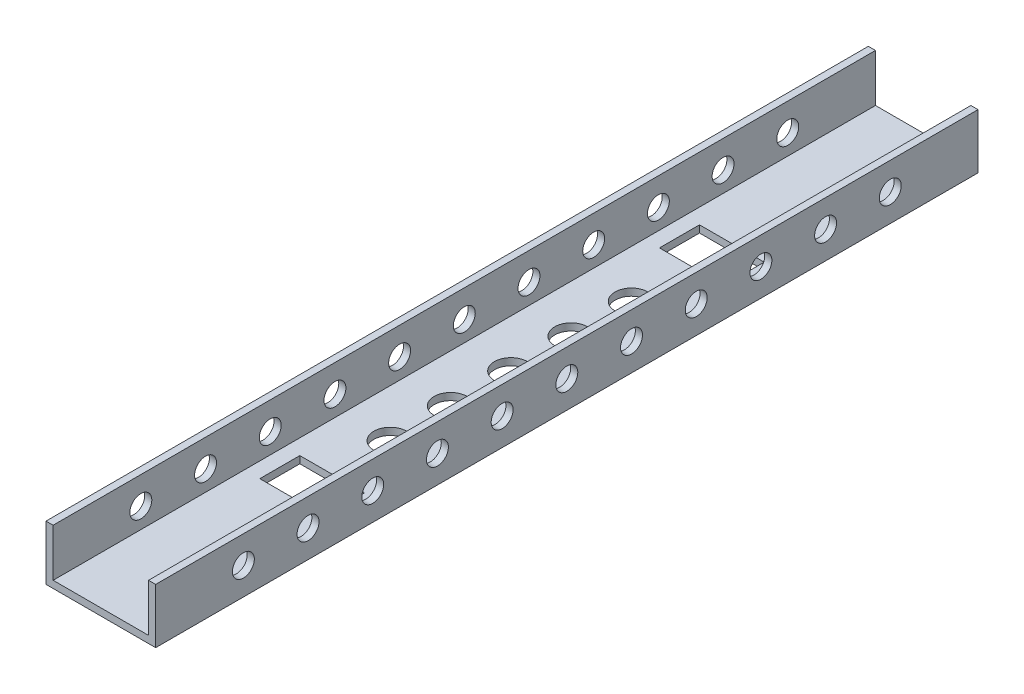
ISO-10303-21;
HEADER;
FILE_DESCRIPTION(('STEP AP214'),'2;1');
FILE_NAME('part.step','',(''),(''),'','','');
FILE_SCHEMA(('AUTOMOTIVE_DESIGN { 1 0 10303 214 1 1 1 1 }'));
ENDSEC;
DATA;
#1=APPLICATION_CONTEXT('core data for automotive mechanical design processes');
#2=APPLICATION_PROTOCOL_DEFINITION('international standard','automotive_design',2000,#1);
#3=PRODUCT_CONTEXT('',#1,'mechanical');
#4=PRODUCT('Part','Part','',(#3));
#5=PRODUCT_RELATED_PRODUCT_CATEGORY('part','',(#4));
#6=PRODUCT_DEFINITION_FORMATION('','',#4);
#7=PRODUCT_DEFINITION_CONTEXT('part definition',#1,'design');
#8=PRODUCT_DEFINITION('design','',#6,#7);
#9=PRODUCT_DEFINITION_SHAPE('','',#8);
#10=(LENGTH_UNIT() NAMED_UNIT(*) SI_UNIT(.MILLI.,.METRE.));
#11=(NAMED_UNIT(*) PLANE_ANGLE_UNIT() SI_UNIT($,.RADIAN.));
#12=(NAMED_UNIT(*) SI_UNIT($,.STERADIAN.) SOLID_ANGLE_UNIT());
#13=UNCERTAINTY_MEASURE_WITH_UNIT(LENGTH_MEASURE(1.E-05),#10,'distance_accuracy_value','');
#14=(GEOMETRIC_REPRESENTATION_CONTEXT(3) GLOBAL_UNCERTAINTY_ASSIGNED_CONTEXT((#13)) GLOBAL_UNIT_ASSIGNED_CONTEXT((#10,
#11,#12)) REPRESENTATION_CONTEXT('',''));
#15=CARTESIAN_POINT('',(0.,0.,0.));
#16=DIRECTION('',(0.,0.,1.));
#17=DIRECTION('',(1.,0.,0.));
#18=AXIS2_PLACEMENT_3D('',#15,#16,#17);
#19=CARTESIAN_POINT('',(-22.9308176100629,-18.8106918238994,381.));
#20=DIRECTION('',(0.,1.,0.));
#21=DIRECTION('',(0.,0.,1.));
#22=AXIS2_PLACEMENT_3D('',#19,#20,#21);
#23=PLANE('',#22);
#24=CARTESIAN_POINT('',(2.46918238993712,-18.8106918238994,246.888));
#25=DIRECTION('',(0.,1.,0.));
#26=DIRECTION('',(0.,0.,1.));
#27=AXIS2_PLACEMENT_3D('',#24,#25,#26);
#28=CIRCLE('',#27,7.62);
#29=CARTESIAN_POINT('',(2.46918238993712,-18.8106918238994,254.508));
#30=VERTEX_POINT('',#29);
#31=EDGE_CURVE('E600',#30,#30,#28,.T.);
#32=ORIENTED_EDGE('',*,*,#31,.T.);
#33=EDGE_LOOP('',(#32));
#34=FACE_BOUND('',#33,.T.);
#35=CARTESIAN_POINT('',(2.46918238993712,-18.8106918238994,218.948));
#36=DIRECTION('',(0.,1.,0.));
#37=DIRECTION('',(0.,0.,1.));
#38=AXIS2_PLACEMENT_3D('',#35,#36,#37);
#39=CIRCLE('',#38,7.62000000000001);
#40=CARTESIAN_POINT('',(2.46918238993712,-18.8106918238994,226.568));
#41=VERTEX_POINT('',#40);
#42=EDGE_CURVE('E604',#41,#41,#39,.T.);
#43=ORIENTED_EDGE('',*,*,#42,.T.);
#44=EDGE_LOOP('',(#43));
#45=FACE_BOUND('',#44,.T.);
#46=CARTESIAN_POINT('',(2.46918238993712,-18.8106918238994,191.008));
#47=DIRECTION('',(0.,1.,0.));
#48=DIRECTION('',(0.,0.,1.));
#49=AXIS2_PLACEMENT_3D('',#46,#47,#48);
#50=CIRCLE('',#49,7.62);
#51=CARTESIAN_POINT('',(2.46918238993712,-18.8106918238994,198.628));
#52=VERTEX_POINT('',#51);
#53=EDGE_CURVE('E613',#52,#52,#50,.T.);
#54=ORIENTED_EDGE('',*,*,#53,.T.);
#55=EDGE_LOOP('',(#54));
#56=FACE_BOUND('',#55,.T.);
#57=CARTESIAN_POINT('',(2.46918238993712,-18.8106918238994,163.068));
#58=DIRECTION('',(0.,1.,0.));
#59=DIRECTION('',(0.,0.,1.));
#60=AXIS2_PLACEMENT_3D('',#57,#58,#59);
#61=CIRCLE('',#60,7.62);
#62=CARTESIAN_POINT('',(2.46918238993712,-18.8106918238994,170.688));
#63=VERTEX_POINT('',#62);
#64=EDGE_CURVE('E619',#63,#63,#61,.T.);
#65=ORIENTED_EDGE('',*,*,#64,.T.);
#66=EDGE_LOOP('',(#65));
#67=FACE_BOUND('',#66,.T.);
#68=CARTESIAN_POINT('',(2.46918238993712,-18.8106918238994,135.128));
#69=DIRECTION('',(0.,1.,0.));
#70=DIRECTION('',(0.,0.,1.));
#71=AXIS2_PLACEMENT_3D('',#68,#69,#70);
#72=CIRCLE('',#71,7.62);
#73=CARTESIAN_POINT('',(2.46918238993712,-18.8106918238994,142.748));
#74=VERTEX_POINT('',#73);
#75=EDGE_CURVE('E625',#74,#74,#72,.T.);
#76=ORIENTED_EDGE('',*,*,#75,.T.);
#77=EDGE_LOOP('',(#76));
#78=FACE_BOUND('',#77,.T.);
#79=DIRECTION('',(-1.,0.,0.));
#80=VECTOR('',#79,1.);
#81=CARTESIAN_POINT('',(-22.9308176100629,-18.8106918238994,273.812));
#82=LINE('',#81,#80);
#83=CARTESIAN_POINT('',(17.4551823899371,-18.8106918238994,273.812));
#84=VERTEX_POINT('',#83);
#85=CARTESIAN_POINT('',(-12.5168176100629,-18.8106918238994,273.812));
#86=VERTEX_POINT('',#85);
#87=EDGE_CURVE('E177',#84,#86,#82,.T.);
#88=ORIENTED_EDGE('',*,*,#87,.T.);
#89=DIRECTION('',(0.,0.,1.));
#90=VECTOR('',#89,1.);
#91=CARTESIAN_POINT('',(-12.5168176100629,-18.8106918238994,381.));
#92=LINE('',#91,#90);
#93=CARTESIAN_POINT('',(-12.5168176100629,-18.8106918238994,292.354));
#94=VERTEX_POINT('',#93);
#95=EDGE_CURVE('E180',#86,#94,#92,.T.);
#96=ORIENTED_EDGE('',*,*,#95,.T.);
#97=DIRECTION('',(1.,0.,0.));
#98=VECTOR('',#97,1.);
#99=CARTESIAN_POINT('',(-22.9308176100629,-18.8106918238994,292.354));
#100=LINE('',#99,#98);
#101=CARTESIAN_POINT('',(17.4551823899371,-18.8106918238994,292.354));
#102=VERTEX_POINT('',#101);
#103=EDGE_CURVE('E172',#94,#102,#100,.T.);
#104=ORIENTED_EDGE('',*,*,#103,.T.);
#105=DIRECTION('',(0.,0.,-1.));
#106=VECTOR('',#105,1.);
#107=CARTESIAN_POINT('',(17.4551823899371,-18.8106918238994,381.));
#108=LINE('',#107,#106);
#109=EDGE_CURVE('E152',#102,#84,#108,.T.);
#110=ORIENTED_EDGE('',*,*,#109,.T.);
#111=EDGE_LOOP('',(#88,#96,#104,#110));
#112=FACE_BOUND('',#111,.T.);
#113=DIRECTION('',(-1.,0.,0.));
#114=VECTOR('',#113,1.);
#115=CARTESIAN_POINT('',(-22.930817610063,-18.8106918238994,88.646));
#116=LINE('',#115,#114);
#117=CARTESIAN_POINT('',(17.4551823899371,-18.8106918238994,88.646));
#118=VERTEX_POINT('',#117);
#119=CARTESIAN_POINT('',(-12.5168176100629,-18.8106918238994,88.646));
#120=VERTEX_POINT('',#119);
#121=EDGE_CURVE('E209',#118,#120,#116,.T.);
#122=ORIENTED_EDGE('',*,*,#121,.T.);
#123=DIRECTION('',(0.,0.,1.));
#124=VECTOR('',#123,1.);
#125=CARTESIAN_POINT('',(-12.5168176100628,-18.8106918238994,381.));
#126=LINE('',#125,#124);
#127=CARTESIAN_POINT('',(-12.5168176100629,-18.8106918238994,107.188));
#128=VERTEX_POINT('',#127);
#129=EDGE_CURVE('E212',#120,#128,#126,.T.);
#130=ORIENTED_EDGE('',*,*,#129,.T.);
#131=DIRECTION('',(1.,0.,0.));
#132=VECTOR('',#131,1.);
#133=CARTESIAN_POINT('',(-22.9308176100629,-18.8106918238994,107.188));
#134=LINE('',#133,#132);
#135=CARTESIAN_POINT('',(17.4551823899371,-18.8106918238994,107.188));
#136=VERTEX_POINT('',#135);
#137=EDGE_CURVE('E197',#128,#136,#134,.T.);
#138=ORIENTED_EDGE('',*,*,#137,.T.);
#139=DIRECTION('',(0.,0.,-1.));
#140=VECTOR('',#139,1.);
#141=CARTESIAN_POINT('',(17.4551823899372,-18.8106918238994,381.));
#142=LINE('',#141,#140);
#143=EDGE_CURVE('E206',#136,#118,#142,.T.);
#144=ORIENTED_EDGE('',*,*,#143,.T.);
#145=EDGE_LOOP('',(#122,#130,#138,#144));
#146=FACE_BOUND('',#145,.T.);
#147=DIRECTION('',(1.,0.,0.));
#148=VECTOR('',#147,1.);
#149=CARTESIAN_POINT('',(-22.9308176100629,-18.8106918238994,0.));
#150=LINE('',#149,#148);
#151=CARTESIAN_POINT('',(-22.9308176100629,-18.8106918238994,0.));
#152=VERTEX_POINT('',#151);
#153=CARTESIAN_POINT('',(27.8691823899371,-18.8106918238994,0.));
#154=VERTEX_POINT('',#153);
#155=EDGE_CURVE('E324',#152,#154,#150,.T.);
#156=ORIENTED_EDGE('',*,*,#155,.T.);
#157=DIRECTION('',(0.,0.,-1.));
#158=VECTOR('',#157,1.);
#159=CARTESIAN_POINT('',(27.8691823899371,-18.8106918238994,381.));
#160=LINE('',#159,#158);
#161=CARTESIAN_POINT('',(27.8691823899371,-18.8106918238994,381.));
#162=VERTEX_POINT('',#161);
#163=EDGE_CURVE('E11',#162,#154,#160,.T.);
#164=ORIENTED_EDGE('',*,*,#163,.F.);
#165=DIRECTION('',(1.,0.,0.));
#166=VECTOR('',#165,1.);
#167=CARTESIAN_POINT('',(-22.9308176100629,-18.8106918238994,381.));
#168=LINE('',#167,#166);
#169=CARTESIAN_POINT('',(-22.9308176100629,-18.8106918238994,381.));
#170=VERTEX_POINT('',#169);
#171=EDGE_CURVE('E325',#170,#162,#168,.T.);
#172=ORIENTED_EDGE('',*,*,#171,.F.);
#173=DIRECTION('',(0.,0.,-1.));
#174=VECTOR('',#173,1.);
#175=CARTESIAN_POINT('',(-22.9308176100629,-18.8106918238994,381.));
#176=LINE('',#175,#174);
#177=EDGE_CURVE('E343',#170,#152,#176,.T.);
#178=ORIENTED_EDGE('',*,*,#177,.T.);
#179=EDGE_LOOP('',(#156,#164,#172,#178));
#180=FACE_BOUND('',#179,.T.);
#181=ADVANCED_FACE('F32',(#34,#45,#56,#67,#78,#112,#146,#180),#23,.F.);
#182=CARTESIAN_POINT('',(27.8691823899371,6.58930817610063,381.));
#183=DIRECTION('',(-1.,0.,0.));
#184=DIRECTION('',(0.,0.,1.));
#185=AXIS2_PLACEMENT_3D('',#182,#183,#184);
#186=PLANE('',#185);
#187=CARTESIAN_POINT('',(27.8691823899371,-6.11069182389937,40.64));
#188=DIRECTION('',(1.,0.,0.));
#189=DIRECTION('',(0.,0.,-1.));
#190=AXIS2_PLACEMENT_3D('',#187,#188,#189);
#191=CIRCLE('',#190,5.08);
#192=CARTESIAN_POINT('',(27.8691823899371,-6.11069182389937,35.56));
#193=VERTEX_POINT('',#192);
#194=EDGE_CURVE('E215',#193,#193,#191,.T.);
#195=ORIENTED_EDGE('',*,*,#194,.F.);
#196=EDGE_LOOP('',(#195));
#197=FACE_BOUND('',#196,.T.);
#198=CARTESIAN_POINT('',(27.8691823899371,-6.11069182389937,70.612));
#199=DIRECTION('',(1.,0.,0.));
#200=DIRECTION('',(0.,0.,-1.));
#201=AXIS2_PLACEMENT_3D('',#198,#199,#200);
#202=CIRCLE('',#201,5.08);
#203=CARTESIAN_POINT('',(27.8691823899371,-6.11069182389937,65.532));
#204=VERTEX_POINT('',#203);
#205=EDGE_CURVE('E224',#204,#204,#202,.T.);
#206=ORIENTED_EDGE('',*,*,#205,.F.);
#207=EDGE_LOOP('',(#206));
#208=FACE_BOUND('',#207,.T.);
#209=CARTESIAN_POINT('',(27.8691823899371,-6.11069182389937,100.584));
#210=DIRECTION('',(1.,0.,0.));
#211=DIRECTION('',(0.,0.,-1.));
#212=AXIS2_PLACEMENT_3D('',#209,#210,#211);
#213=CIRCLE('',#212,5.08);
#214=CARTESIAN_POINT('',(27.8691823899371,-6.11069182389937,95.504));
#215=VERTEX_POINT('',#214);
#216=EDGE_CURVE('E234',#215,#215,#213,.T.);
#217=ORIENTED_EDGE('',*,*,#216,.F.);
#218=EDGE_LOOP('',(#217));
#219=FACE_BOUND('',#218,.T.);
#220=CARTESIAN_POINT('',(27.8691823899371,-6.11069182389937,130.556));
#221=DIRECTION('',(1.,0.,0.));
#222=DIRECTION('',(0.,0.,-1.));
#223=AXIS2_PLACEMENT_3D('',#220,#221,#222);
#224=CIRCLE('',#223,5.07999999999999);
#225=CARTESIAN_POINT('',(27.8691823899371,-6.11069182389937,125.476));
#226=VERTEX_POINT('',#225);
#227=EDGE_CURVE('E244',#226,#226,#224,.T.);
#228=ORIENTED_EDGE('',*,*,#227,.F.);
#229=EDGE_LOOP('',(#228));
#230=FACE_BOUND('',#229,.T.);
#231=CARTESIAN_POINT('',(27.8691823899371,-6.11069182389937,160.528));
#232=DIRECTION('',(1.,0.,0.));
#233=DIRECTION('',(0.,0.,-1.));
#234=AXIS2_PLACEMENT_3D('',#231,#232,#233);
#235=CIRCLE('',#234,5.07999999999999);
#236=CARTESIAN_POINT('',(27.8691823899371,-6.11069182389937,155.448));
#237=VERTEX_POINT('',#236);
#238=EDGE_CURVE('E254',#237,#237,#235,.T.);
#239=ORIENTED_EDGE('',*,*,#238,.F.);
#240=EDGE_LOOP('',(#239));
#241=FACE_BOUND('',#240,.T.);
#242=CARTESIAN_POINT('',(27.8691823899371,-6.11069182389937,340.36));
#243=DIRECTION('',(1.,0.,0.));
#244=DIRECTION('',(0.,0.,-1.));
#245=AXIS2_PLACEMENT_3D('',#242,#243,#244);
#246=CIRCLE('',#245,5.07999999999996);
#247=CARTESIAN_POINT('',(27.8691823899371,-6.11069182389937,335.28));
#248=VERTEX_POINT('',#247);
#249=EDGE_CURVE('E264',#248,#248,#246,.T.);
#250=ORIENTED_EDGE('',*,*,#249,.F.);
#251=EDGE_LOOP('',(#250));
#252=FACE_BOUND('',#251,.T.);
#253=CARTESIAN_POINT('',(27.8691823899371,-6.11069182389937,310.388));
#254=DIRECTION('',(1.,0.,0.));
#255=DIRECTION('',(0.,0.,-1.));
#256=AXIS2_PLACEMENT_3D('',#253,#254,#255);
#257=CIRCLE('',#256,5.07999999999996);
#258=CARTESIAN_POINT('',(27.8691823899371,-6.11069182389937,305.308));
#259=VERTEX_POINT('',#258);
#260=EDGE_CURVE('E274',#259,#259,#257,.T.);
#261=ORIENTED_EDGE('',*,*,#260,.F.);
#262=EDGE_LOOP('',(#261));
#263=FACE_BOUND('',#262,.T.);
#264=CARTESIAN_POINT('',(27.8691823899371,-6.11069182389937,280.416));
#265=DIRECTION('',(1.,0.,0.));
#266=DIRECTION('',(0.,0.,-1.));
#267=AXIS2_PLACEMENT_3D('',#264,#265,#266);
#268=CIRCLE('',#267,5.07999999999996);
#269=CARTESIAN_POINT('',(27.8691823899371,-6.11069182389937,275.336));
#270=VERTEX_POINT('',#269);
#271=EDGE_CURVE('E284',#270,#270,#268,.T.);
#272=ORIENTED_EDGE('',*,*,#271,.F.);
#273=EDGE_LOOP('',(#272));
#274=FACE_BOUND('',#273,.T.);
#275=CARTESIAN_POINT('',(27.8691823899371,-6.11069182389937,250.444));
#276=DIRECTION('',(1.,0.,0.));
#277=DIRECTION('',(0.,0.,-1.));
#278=AXIS2_PLACEMENT_3D('',#275,#276,#277);
#279=CIRCLE('',#278,5.07999999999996);
#280=CARTESIAN_POINT('',(27.8691823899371,-6.11069182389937,245.364));
#281=VERTEX_POINT('',#280);
#282=EDGE_CURVE('E294',#281,#281,#279,.T.);
#283=ORIENTED_EDGE('',*,*,#282,.F.);
#284=EDGE_LOOP('',(#283));
#285=FACE_BOUND('',#284,.T.);
#286=CARTESIAN_POINT('',(27.8691823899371,-6.11069182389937,220.472));
#287=DIRECTION('',(1.,0.,0.));
#288=DIRECTION('',(0.,0.,-1.));
#289=AXIS2_PLACEMENT_3D('',#286,#287,#288);
#290=CIRCLE('',#289,5.07999999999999);
#291=CARTESIAN_POINT('',(27.8691823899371,-6.11069182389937,215.392));
#292=VERTEX_POINT('',#291);
#293=EDGE_CURVE('E304',#292,#292,#290,.T.);
#294=ORIENTED_EDGE('',*,*,#293,.F.);
#295=EDGE_LOOP('',(#294));
#296=FACE_BOUND('',#295,.T.);
#297=CARTESIAN_POINT('',(27.8691823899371,-6.11069182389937,190.5));
#298=DIRECTION('',(1.,0.,0.));
#299=DIRECTION('',(0.,0.,-1.));
#300=AXIS2_PLACEMENT_3D('',#297,#298,#299);
#301=CIRCLE('',#300,5.07999999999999);
#302=CARTESIAN_POINT('',(27.8691823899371,-6.11069182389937,185.42));
#303=VERTEX_POINT('',#302);
#304=EDGE_CURVE('E314',#303,#303,#301,.T.);
#305=ORIENTED_EDGE('',*,*,#304,.F.);
#306=EDGE_LOOP('',(#305));
#307=FACE_BOUND('',#306,.T.);
#308=DIRECTION('',(0.,1.,0.));
#309=VECTOR('',#308,1.);
#310=CARTESIAN_POINT('',(27.8691823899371,6.58930817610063,0.));
#311=LINE('',#310,#309);
#312=CARTESIAN_POINT('',(27.8691823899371,6.58930817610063,0.));
#313=VERTEX_POINT('',#312);
#314=EDGE_CURVE('E346',#154,#313,#311,.T.);
#315=ORIENTED_EDGE('',*,*,#314,.T.);
#316=DIRECTION('',(0.,0.,-1.));
#317=VECTOR('',#316,1.);
#318=CARTESIAN_POINT('',(27.8691823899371,6.58930817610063,381.));
#319=LINE('',#318,#317);
#320=CARTESIAN_POINT('',(27.8691823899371,6.58930817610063,381.));
#321=VERTEX_POINT('',#320);
#322=EDGE_CURVE('E40',#321,#313,#319,.T.);
#323=ORIENTED_EDGE('',*,*,#322,.F.);
#324=DIRECTION('',(0.,1.,0.));
#325=VECTOR('',#324,1.);
#326=CARTESIAN_POINT('',(27.8691823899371,6.58930817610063,381.));
#327=LINE('',#326,#325);
#328=EDGE_CURVE('E328',#162,#321,#327,.T.);
#329=ORIENTED_EDGE('',*,*,#328,.F.);
#330=ORIENTED_EDGE('',*,*,#163,.T.);
#331=EDGE_LOOP('',(#315,#323,#329,#330));
#332=FACE_BOUND('',#331,.T.);
#333=ADVANCED_FACE('F468',(#197,#208,#219,#230,#241,#252,#263,#274,#285,#296,#307,#332),#186,.F.);
#334=CARTESIAN_POINT('',(27.8691823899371,6.58930817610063,381.));
#335=DIRECTION('',(0.,-1.,0.));
#336=DIRECTION('',(1.,0.,0.));
#337=AXIS2_PLACEMENT_3D('',#334,#335,#336);
#338=PLANE('',#337);
#339=DIRECTION('',(-1.,0.,0.));
#340=VECTOR('',#339,1.);
#341=CARTESIAN_POINT('',(27.8691823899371,6.58930817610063,0.));
#342=LINE('',#341,#340);
#343=CARTESIAN_POINT('',(24.5671823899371,6.58930817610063,0.));
#344=VERTEX_POINT('',#343);
#345=EDGE_CURVE('E348',#313,#344,#342,.T.);
#346=ORIENTED_EDGE('',*,*,#345,.T.);
#347=DIRECTION('',(0.,0.,-1.));
#348=VECTOR('',#347,1.);
#349=CARTESIAN_POINT('',(24.5671823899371,6.58930817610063,381.));
#350=LINE('',#349,#348);
#351=CARTESIAN_POINT('',(24.5671823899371,6.58930817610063,381.));
#352=VERTEX_POINT('',#351);
#353=EDGE_CURVE('E373',#352,#344,#350,.T.);
#354=ORIENTED_EDGE('',*,*,#353,.F.);
#355=DIRECTION('',(-1.,0.,0.));
#356=VECTOR('',#355,1.);
#357=CARTESIAN_POINT('',(27.8691823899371,6.58930817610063,381.));
#358=LINE('',#357,#356);
#359=EDGE_CURVE('E331',#321,#352,#358,.T.);
#360=ORIENTED_EDGE('',*,*,#359,.F.);
#361=ORIENTED_EDGE('',*,*,#322,.T.);
#362=EDGE_LOOP('',(#346,#354,#360,#361));
#363=FACE_BOUND('',#362,.T.);
#364=ADVANCED_FACE('F466',(#363),#338,.F.);
#365=CARTESIAN_POINT('',(24.5671823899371,6.58930817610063,381.));
#366=DIRECTION('',(1.,0.,0.));
#367=DIRECTION('',(0.,1.,0.));
#368=AXIS2_PLACEMENT_3D('',#365,#366,#367);
#369=PLANE('',#368);
#370=CARTESIAN_POINT('',(24.5671823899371,-6.11069182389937,40.64));
#371=DIRECTION('',(1.,0.,0.));
#372=DIRECTION('',(0.,1.,0.));
#373=AXIS2_PLACEMENT_3D('',#370,#371,#372);
#374=CIRCLE('',#373,5.08);
#375=CARTESIAN_POINT('',(24.5671823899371,-1.03069182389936,40.64));
#376=VERTEX_POINT('',#375);
#377=EDGE_CURVE('E221',#376,#376,#374,.T.);
#378=ORIENTED_EDGE('',*,*,#377,.T.);
#379=EDGE_LOOP('',(#378));
#380=FACE_BOUND('',#379,.T.);
#381=CARTESIAN_POINT('',(24.5671823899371,-6.11069182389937,70.612));
#382=DIRECTION('',(1.,0.,0.));
#383=DIRECTION('',(0.,1.,0.));
#384=AXIS2_PLACEMENT_3D('',#381,#382,#383);
#385=CIRCLE('',#384,5.08);
#386=CARTESIAN_POINT('',(24.5671823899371,-1.03069182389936,70.612));
#387=VERTEX_POINT('',#386);
#388=EDGE_CURVE('E231',#387,#387,#385,.T.);
#389=ORIENTED_EDGE('',*,*,#388,.T.);
#390=EDGE_LOOP('',(#389));
#391=FACE_BOUND('',#390,.T.);
#392=CARTESIAN_POINT('',(24.5671823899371,-6.11069182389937,100.584));
#393=DIRECTION('',(1.,0.,0.));
#394=DIRECTION('',(0.,1.,0.));
#395=AXIS2_PLACEMENT_3D('',#392,#393,#394);
#396=CIRCLE('',#395,5.08);
#397=CARTESIAN_POINT('',(24.5671823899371,-1.03069182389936,100.584));
#398=VERTEX_POINT('',#397);
#399=EDGE_CURVE('E241',#398,#398,#396,.T.);
#400=ORIENTED_EDGE('',*,*,#399,.T.);
#401=EDGE_LOOP('',(#400));
#402=FACE_BOUND('',#401,.T.);
#403=CARTESIAN_POINT('',(24.5671823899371,-6.11069182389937,130.556));
#404=DIRECTION('',(1.,0.,0.));
#405=DIRECTION('',(0.,1.,0.));
#406=AXIS2_PLACEMENT_3D('',#403,#404,#405);
#407=CIRCLE('',#406,5.07999999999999);
#408=CARTESIAN_POINT('',(24.5671823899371,-1.03069182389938,130.556));
#409=VERTEX_POINT('',#408);
#410=EDGE_CURVE('E251',#409,#409,#407,.T.);
#411=ORIENTED_EDGE('',*,*,#410,.T.);
#412=EDGE_LOOP('',(#411));
#413=FACE_BOUND('',#412,.T.);
#414=CARTESIAN_POINT('',(24.5671823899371,-6.11069182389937,160.528));
#415=DIRECTION('',(1.,0.,0.));
#416=DIRECTION('',(0.,1.,0.));
#417=AXIS2_PLACEMENT_3D('',#414,#415,#416);
#418=CIRCLE('',#417,5.07999999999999);
#419=CARTESIAN_POINT('',(24.5671823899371,-1.03069182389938,160.528));
#420=VERTEX_POINT('',#419);
#421=EDGE_CURVE('E261',#420,#420,#418,.T.);
#422=ORIENTED_EDGE('',*,*,#421,.T.);
#423=EDGE_LOOP('',(#422));
#424=FACE_BOUND('',#423,.T.);
#425=CARTESIAN_POINT('',(24.5671823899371,-6.11069182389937,340.36));
#426=DIRECTION('',(1.,0.,0.));
#427=DIRECTION('',(0.,1.,0.));
#428=AXIS2_PLACEMENT_3D('',#425,#426,#427);
#429=CIRCLE('',#428,5.07999999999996);
#430=CARTESIAN_POINT('',(24.5671823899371,-1.0306918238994,340.36));
#431=VERTEX_POINT('',#430);
#432=EDGE_CURVE('E271',#431,#431,#429,.T.);
#433=ORIENTED_EDGE('',*,*,#432,.T.);
#434=EDGE_LOOP('',(#433));
#435=FACE_BOUND('',#434,.T.);
#436=CARTESIAN_POINT('',(24.5671823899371,-6.11069182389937,310.388));
#437=DIRECTION('',(1.,0.,0.));
#438=DIRECTION('',(0.,1.,0.));
#439=AXIS2_PLACEMENT_3D('',#436,#437,#438);
#440=CIRCLE('',#439,5.07999999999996);
#441=CARTESIAN_POINT('',(24.5671823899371,-1.0306918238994,310.388));
#442=VERTEX_POINT('',#441);
#443=EDGE_CURVE('E281',#442,#442,#440,.T.);
#444=ORIENTED_EDGE('',*,*,#443,.T.);
#445=EDGE_LOOP('',(#444));
#446=FACE_BOUND('',#445,.T.);
#447=CARTESIAN_POINT('',(24.5671823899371,-6.11069182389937,280.416));
#448=DIRECTION('',(1.,0.,0.));
#449=DIRECTION('',(0.,1.,0.));
#450=AXIS2_PLACEMENT_3D('',#447,#448,#449);
#451=CIRCLE('',#450,5.07999999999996);
#452=CARTESIAN_POINT('',(24.5671823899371,-1.0306918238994,280.416));
#453=VERTEX_POINT('',#452);
#454=EDGE_CURVE('E291',#453,#453,#451,.T.);
#455=ORIENTED_EDGE('',*,*,#454,.T.);
#456=EDGE_LOOP('',(#455));
#457=FACE_BOUND('',#456,.T.);
#458=CARTESIAN_POINT('',(24.5671823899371,-6.11069182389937,250.444));
#459=DIRECTION('',(1.,0.,0.));
#460=DIRECTION('',(0.,1.,0.));
#461=AXIS2_PLACEMENT_3D('',#458,#459,#460);
#462=CIRCLE('',#461,5.07999999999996);
#463=CARTESIAN_POINT('',(24.5671823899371,-1.0306918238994,250.444));
#464=VERTEX_POINT('',#463);
#465=EDGE_CURVE('E301',#464,#464,#462,.T.);
#466=ORIENTED_EDGE('',*,*,#465,.T.);
#467=EDGE_LOOP('',(#466));
#468=FACE_BOUND('',#467,.T.);
#469=CARTESIAN_POINT('',(24.5671823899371,-6.11069182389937,220.472));
#470=DIRECTION('',(1.,0.,0.));
#471=DIRECTION('',(0.,1.,0.));
#472=AXIS2_PLACEMENT_3D('',#469,#470,#471);
#473=CIRCLE('',#472,5.07999999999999);
#474=CARTESIAN_POINT('',(24.5671823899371,-1.03069182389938,220.472));
#475=VERTEX_POINT('',#474);
#476=EDGE_CURVE('E311',#475,#475,#473,.T.);
#477=ORIENTED_EDGE('',*,*,#476,.T.);
#478=EDGE_LOOP('',(#477));
#479=FACE_BOUND('',#478,.T.);
#480=CARTESIAN_POINT('',(24.5671823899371,-6.11069182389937,190.5));
#481=DIRECTION('',(1.,0.,0.));
#482=DIRECTION('',(0.,1.,0.));
#483=AXIS2_PLACEMENT_3D('',#480,#481,#482);
#484=CIRCLE('',#483,5.07999999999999);
#485=CARTESIAN_POINT('',(24.5671823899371,-6.11069182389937,185.42));
#486=VERTEX_POINT('',#485);
#487=EDGE_CURVE('E321',#486,#486,#484,.T.);
#488=ORIENTED_EDGE('',*,*,#487,.T.);
#489=EDGE_LOOP('',(#488));
#490=FACE_BOUND('',#489,.T.);
#491=DIRECTION('',(0.,-1.,0.));
#492=VECTOR('',#491,1.);
#493=CARTESIAN_POINT('',(24.5671823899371,6.58930817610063,0.));
#494=LINE('',#493,#492);
#495=CARTESIAN_POINT('',(24.5671823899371,-15.5086918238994,0.));
#496=VERTEX_POINT('',#495);
#497=EDGE_CURVE('E350',#344,#496,#494,.T.);
#498=ORIENTED_EDGE('',*,*,#497,.T.);
#499=DIRECTION('',(0.,0.,-1.));
#500=VECTOR('',#499,1.);
#501=CARTESIAN_POINT('',(24.5671823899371,-15.5086918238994,381.));
#502=LINE('',#501,#500);
#503=CARTESIAN_POINT('',(24.5671823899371,-15.5086918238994,381.));
#504=VERTEX_POINT('',#503);
#505=EDGE_CURVE('E370',#504,#496,#502,.T.);
#506=ORIENTED_EDGE('',*,*,#505,.F.);
#507=DIRECTION('',(0.,-1.,0.));
#508=VECTOR('',#507,1.);
#509=CARTESIAN_POINT('',(24.5671823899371,6.58930817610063,381.));
#510=LINE('',#509,#508);
#511=EDGE_CURVE('E333',#352,#504,#510,.T.);
#512=ORIENTED_EDGE('',*,*,#511,.F.);
#513=ORIENTED_EDGE('',*,*,#353,.T.);
#514=EDGE_LOOP('',(#498,#506,#512,#513));
#515=FACE_BOUND('',#514,.T.);
#516=ADVANCED_FACE('F462',(#380,#391,#402,#413,#424,#435,#446,#457,#468,#479,#490,#515),#369,.F.);
#517=CARTESIAN_POINT('',(-19.6288176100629,-15.5086918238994,381.));
#518=DIRECTION('',(0.,-1.,0.));
#519=DIRECTION('',(0.,0.,-1.));
#520=AXIS2_PLACEMENT_3D('',#517,#518,#519);
#521=PLANE('',#520);
#522=CARTESIAN_POINT('',(2.46918238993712,-15.5086918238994,246.888));
#523=DIRECTION('',(0.,1.,0.));
#524=DIRECTION('',(0.,0.,1.));
#525=AXIS2_PLACEMENT_3D('',#522,#523,#524);
#526=CIRCLE('',#525,7.62);
#527=CARTESIAN_POINT('',(2.46918238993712,-15.5086918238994,254.508));
#528=VERTEX_POINT('',#527);
#529=EDGE_CURVE('E597',#528,#528,#526,.T.);
#530=ORIENTED_EDGE('',*,*,#529,.F.);
#531=EDGE_LOOP('',(#530));
#532=FACE_BOUND('',#531,.T.);
#533=CARTESIAN_POINT('',(2.46918238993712,-15.5086918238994,218.948));
#534=DIRECTION('',(0.,1.,0.));
#535=DIRECTION('',(0.,0.,1.));
#536=AXIS2_PLACEMENT_3D('',#533,#534,#535);
#537=CIRCLE('',#536,7.62000000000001);
#538=CARTESIAN_POINT('',(2.46918238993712,-15.5086918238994,226.568));
#539=VERTEX_POINT('',#538);
#540=EDGE_CURVE('E601',#539,#539,#537,.T.);
#541=ORIENTED_EDGE('',*,*,#540,.F.);
#542=EDGE_LOOP('',(#541));
#543=FACE_BOUND('',#542,.T.);
#544=CARTESIAN_POINT('',(2.46918238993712,-15.5086918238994,191.008));
#545=DIRECTION('',(0.,1.,0.));
#546=DIRECTION('',(0.,0.,1.));
#547=AXIS2_PLACEMENT_3D('',#544,#545,#546);
#548=CIRCLE('',#547,7.62);
#549=CARTESIAN_POINT('',(2.46918238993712,-15.5086918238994,198.628));
#550=VERTEX_POINT('',#549);
#551=EDGE_CURVE('E610',#550,#550,#548,.T.);
#552=ORIENTED_EDGE('',*,*,#551,.F.);
#553=EDGE_LOOP('',(#552));
#554=FACE_BOUND('',#553,.T.);
#555=CARTESIAN_POINT('',(2.46918238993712,-15.5086918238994,163.068));
#556=DIRECTION('',(0.,1.,0.));
#557=DIRECTION('',(0.,0.,1.));
#558=AXIS2_PLACEMENT_3D('',#555,#556,#557);
#559=CIRCLE('',#558,7.62);
#560=CARTESIAN_POINT('',(2.46918238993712,-15.5086918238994,170.688));
#561=VERTEX_POINT('',#560);
#562=EDGE_CURVE('E616',#561,#561,#559,.T.);
#563=ORIENTED_EDGE('',*,*,#562,.F.);
#564=EDGE_LOOP('',(#563));
#565=FACE_BOUND('',#564,.T.);
#566=CARTESIAN_POINT('',(2.46918238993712,-15.5086918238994,135.128));
#567=DIRECTION('',(0.,1.,0.));
#568=DIRECTION('',(0.,0.,1.));
#569=AXIS2_PLACEMENT_3D('',#566,#567,#568);
#570=CIRCLE('',#569,7.62);
#571=CARTESIAN_POINT('',(2.46918238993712,-15.5086918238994,142.748));
#572=VERTEX_POINT('',#571);
#573=EDGE_CURVE('E622',#572,#572,#570,.T.);
#574=ORIENTED_EDGE('',*,*,#573,.F.);
#575=EDGE_LOOP('',(#574));
#576=FACE_BOUND('',#575,.T.);
#577=DIRECTION('',(1.,0.,0.));
#578=VECTOR('',#577,1.);
#579=CARTESIAN_POINT('',(-12.5168176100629,-15.5086918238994,292.354));
#580=LINE('',#579,#578);
#581=CARTESIAN_POINT('',(-12.5168176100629,-15.5086918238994,292.354));
#582=VERTEX_POINT('',#581);
#583=CARTESIAN_POINT('',(17.4551823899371,-15.5086918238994,292.354));
#584=VERTEX_POINT('',#583);
#585=EDGE_CURVE('E158',#582,#584,#580,.T.);
#586=ORIENTED_EDGE('',*,*,#585,.F.);
#587=DIRECTION('',(0.,0.,1.));
#588=VECTOR('',#587,1.);
#589=CARTESIAN_POINT('',(-12.5168176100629,-15.5086918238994,292.354));
#590=LINE('',#589,#588);
#591=CARTESIAN_POINT('',(-12.5168176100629,-15.5086918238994,273.812));
#592=VERTEX_POINT('',#591);
#593=EDGE_CURVE('E56',#592,#582,#590,.T.);
#594=ORIENTED_EDGE('',*,*,#593,.F.);
#595=DIRECTION('',(-1.,0.,0.));
#596=VECTOR('',#595,1.);
#597=CARTESIAN_POINT('',(-12.5168176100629,-15.5086918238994,273.812));
#598=LINE('',#597,#596);
#599=CARTESIAN_POINT('',(17.4551823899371,-15.5086918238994,273.812));
#600=VERTEX_POINT('',#599);
#601=EDGE_CURVE('E165',#600,#592,#598,.T.);
#602=ORIENTED_EDGE('',*,*,#601,.F.);
#603=DIRECTION('',(0.,0.,-1.));
#604=VECTOR('',#603,1.);
#605=CARTESIAN_POINT('',(17.4551823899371,-15.5086918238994,292.354));
#606=LINE('',#605,#604);
#607=EDGE_CURVE('E149',#584,#600,#606,.T.);
#608=ORIENTED_EDGE('',*,*,#607,.F.);
#609=EDGE_LOOP('',(#586,#594,#602,#608));
#610=FACE_BOUND('',#609,.T.);
#611=DIRECTION('',(1.,0.,0.));
#612=VECTOR('',#611,1.);
#613=CARTESIAN_POINT('',(-12.5168176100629,-15.5086918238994,107.188));
#614=LINE('',#613,#612);
#615=CARTESIAN_POINT('',(-12.5168176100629,-15.5086918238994,107.188));
#616=VERTEX_POINT('',#615);
#617=CARTESIAN_POINT('',(17.4551823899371,-15.5086918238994,107.188));
#618=VERTEX_POINT('',#617);
#619=EDGE_CURVE('E185',#616,#618,#614,.T.);
#620=ORIENTED_EDGE('',*,*,#619,.F.);
#621=DIRECTION('',(0.,0.,1.));
#622=VECTOR('',#621,1.);
#623=CARTESIAN_POINT('',(-12.5168176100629,-15.5086918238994,88.646));
#624=LINE('',#623,#622);
#625=CARTESIAN_POINT('',(-12.5168176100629,-15.5086918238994,88.646));
#626=VERTEX_POINT('',#625);
#627=EDGE_CURVE('E183',#626,#616,#624,.T.);
#628=ORIENTED_EDGE('',*,*,#627,.F.);
#629=DIRECTION('',(-1.,0.,0.));
#630=VECTOR('',#629,1.);
#631=CARTESIAN_POINT('',(-12.5168176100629,-15.5086918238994,88.646));
#632=LINE('',#631,#630);
#633=CARTESIAN_POINT('',(17.4551823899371,-15.5086918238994,88.646));
#634=VERTEX_POINT('',#633);
#635=EDGE_CURVE('E191',#634,#626,#632,.T.);
#636=ORIENTED_EDGE('',*,*,#635,.F.);
#637=DIRECTION('',(0.,0.,-1.));
#638=VECTOR('',#637,1.);
#639=CARTESIAN_POINT('',(17.4551823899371,-15.5086918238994,88.646));
#640=LINE('',#639,#638);
#641=EDGE_CURVE('E188',#618,#634,#640,.T.);
#642=ORIENTED_EDGE('',*,*,#641,.F.);
#643=EDGE_LOOP('',(#620,#628,#636,#642));
#644=FACE_BOUND('',#643,.T.);
#645=DIRECTION('',(-1.,0.,0.));
#646=VECTOR('',#645,1.);
#647=CARTESIAN_POINT('',(-19.6288176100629,-15.5086918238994,0.));
#648=LINE('',#647,#646);
#649=CARTESIAN_POINT('',(-19.6288176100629,-15.5086918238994,0.));
#650=VERTEX_POINT('',#649);
#651=EDGE_CURVE('E352',#496,#650,#648,.T.);
#652=ORIENTED_EDGE('',*,*,#651,.T.);
#653=DIRECTION('',(0.,0.,-1.));
#654=VECTOR('',#653,1.);
#655=CARTESIAN_POINT('',(-19.6288176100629,-15.5086918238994,381.));
#656=LINE('',#655,#654);
#657=CARTESIAN_POINT('',(-19.6288176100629,-15.5086918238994,381.));
#658=VERTEX_POINT('',#657);
#659=EDGE_CURVE('E367',#658,#650,#656,.T.);
#660=ORIENTED_EDGE('',*,*,#659,.F.);
#661=DIRECTION('',(-1.,0.,0.));
#662=VECTOR('',#661,1.);
#663=CARTESIAN_POINT('',(-19.6288176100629,-15.5086918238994,381.));
#664=LINE('',#663,#662);
#665=EDGE_CURVE('E335',#504,#658,#664,.T.);
#666=ORIENTED_EDGE('',*,*,#665,.F.);
#667=ORIENTED_EDGE('',*,*,#505,.T.);
#668=EDGE_LOOP('',(#652,#660,#666,#667));
#669=FACE_BOUND('',#668,.T.);
#670=ADVANCED_FACE('F162',(#532,#543,#554,#565,#576,#610,#644,#669),#521,.F.);
#671=CARTESIAN_POINT('',(-19.6288176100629,6.58930817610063,381.));
#672=DIRECTION('',(-1.,0.,0.));
#673=DIRECTION('',(0.,-1.,0.));
#674=AXIS2_PLACEMENT_3D('',#671,#672,#673);
#675=PLANE('',#674);
#676=CARTESIAN_POINT('',(-19.6288176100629,-6.11069182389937,40.64));
#677=DIRECTION('',(-1.,0.,0.));
#678=DIRECTION('',(0.,-1.,0.));
#679=AXIS2_PLACEMENT_3D('',#676,#677,#678);
#680=CIRCLE('',#679,5.08);
#681=CARTESIAN_POINT('',(-19.6288176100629,-11.1906918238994,40.64));
#682=VERTEX_POINT('',#681);
#683=EDGE_CURVE('E218',#682,#682,#680,.T.);
#684=ORIENTED_EDGE('',*,*,#683,.T.);
#685=EDGE_LOOP('',(#684));
#686=FACE_BOUND('',#685,.T.);
#687=CARTESIAN_POINT('',(-19.6288176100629,-6.11069182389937,70.612));
#688=DIRECTION('',(-1.,0.,0.));
#689=DIRECTION('',(0.,-1.,0.));
#690=AXIS2_PLACEMENT_3D('',#687,#688,#689);
#691=CIRCLE('',#690,5.08);
#692=CARTESIAN_POINT('',(-19.6288176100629,-11.1906918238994,70.612));
#693=VERTEX_POINT('',#692);
#694=EDGE_CURVE('E228',#693,#693,#691,.T.);
#695=ORIENTED_EDGE('',*,*,#694,.T.);
#696=EDGE_LOOP('',(#695));
#697=FACE_BOUND('',#696,.T.);
#698=CARTESIAN_POINT('',(-19.6288176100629,-6.11069182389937,100.584));
#699=DIRECTION('',(-1.,0.,0.));
#700=DIRECTION('',(0.,-1.,0.));
#701=AXIS2_PLACEMENT_3D('',#698,#699,#700);
#702=CIRCLE('',#701,5.08);
#703=CARTESIAN_POINT('',(-19.6288176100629,-11.1906918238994,100.584));
#704=VERTEX_POINT('',#703);
#705=EDGE_CURVE('E238',#704,#704,#702,.T.);
#706=ORIENTED_EDGE('',*,*,#705,.T.);
#707=EDGE_LOOP('',(#706));
#708=FACE_BOUND('',#707,.T.);
#709=CARTESIAN_POINT('',(-19.6288176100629,-6.11069182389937,130.556));
#710=DIRECTION('',(-1.,0.,0.));
#711=DIRECTION('',(0.,-1.,0.));
#712=AXIS2_PLACEMENT_3D('',#709,#710,#711);
#713=CIRCLE('',#712,5.07999999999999);
#714=CARTESIAN_POINT('',(-19.6288176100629,-11.1906918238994,130.556));
#715=VERTEX_POINT('',#714);
#716=EDGE_CURVE('E248',#715,#715,#713,.T.);
#717=ORIENTED_EDGE('',*,*,#716,.T.);
#718=EDGE_LOOP('',(#717));
#719=FACE_BOUND('',#718,.T.);
#720=CARTESIAN_POINT('',(-19.6288176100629,-6.11069182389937,160.528));
#721=DIRECTION('',(-1.,0.,0.));
#722=DIRECTION('',(0.,-1.,0.));
#723=AXIS2_PLACEMENT_3D('',#720,#721,#722);
#724=CIRCLE('',#723,5.07999999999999);
#725=CARTESIAN_POINT('',(-19.6288176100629,-11.1906918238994,160.528));
#726=VERTEX_POINT('',#725);
#727=EDGE_CURVE('E258',#726,#726,#724,.T.);
#728=ORIENTED_EDGE('',*,*,#727,.T.);
#729=EDGE_LOOP('',(#728));
#730=FACE_BOUND('',#729,.T.);
#731=CARTESIAN_POINT('',(-19.6288176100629,-6.11069182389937,340.36));
#732=DIRECTION('',(-1.,0.,0.));
#733=DIRECTION('',(0.,-1.,0.));
#734=AXIS2_PLACEMENT_3D('',#731,#732,#733);
#735=CIRCLE('',#734,5.07999999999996);
#736=CARTESIAN_POINT('',(-19.6288176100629,-11.1906918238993,340.36));
#737=VERTEX_POINT('',#736);
#738=EDGE_CURVE('E268',#737,#737,#735,.T.);
#739=ORIENTED_EDGE('',*,*,#738,.T.);
#740=EDGE_LOOP('',(#739));
#741=FACE_BOUND('',#740,.T.);
#742=CARTESIAN_POINT('',(-19.6288176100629,-6.11069182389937,310.388));
#743=DIRECTION('',(-1.,0.,0.));
#744=DIRECTION('',(0.,-1.,0.));
#745=AXIS2_PLACEMENT_3D('',#742,#743,#744);
#746=CIRCLE('',#745,5.07999999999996);
#747=CARTESIAN_POINT('',(-19.6288176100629,-11.1906918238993,310.388));
#748=VERTEX_POINT('',#747);
#749=EDGE_CURVE('E278',#748,#748,#746,.T.);
#750=ORIENTED_EDGE('',*,*,#749,.T.);
#751=EDGE_LOOP('',(#750));
#752=FACE_BOUND('',#751,.T.);
#753=CARTESIAN_POINT('',(-19.6288176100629,-6.11069182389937,280.416));
#754=DIRECTION('',(-1.,0.,0.));
#755=DIRECTION('',(0.,-1.,0.));
#756=AXIS2_PLACEMENT_3D('',#753,#754,#755);
#757=CIRCLE('',#756,5.07999999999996);
#758=CARTESIAN_POINT('',(-19.6288176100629,-11.1906918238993,280.416));
#759=VERTEX_POINT('',#758);
#760=EDGE_CURVE('E288',#759,#759,#757,.T.);
#761=ORIENTED_EDGE('',*,*,#760,.T.);
#762=EDGE_LOOP('',(#761));
#763=FACE_BOUND('',#762,.T.);
#764=CARTESIAN_POINT('',(-19.6288176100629,-6.11069182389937,250.444));
#765=DIRECTION('',(-1.,0.,0.));
#766=DIRECTION('',(0.,-1.,0.));
#767=AXIS2_PLACEMENT_3D('',#764,#765,#766);
#768=CIRCLE('',#767,5.07999999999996);
#769=CARTESIAN_POINT('',(-19.6288176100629,-11.1906918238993,250.444));
#770=VERTEX_POINT('',#769);
#771=EDGE_CURVE('E298',#770,#770,#768,.T.);
#772=ORIENTED_EDGE('',*,*,#771,.T.);
#773=EDGE_LOOP('',(#772));
#774=FACE_BOUND('',#773,.T.);
#775=CARTESIAN_POINT('',(-19.6288176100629,-6.11069182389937,220.472));
#776=DIRECTION('',(-1.,0.,0.));
#777=DIRECTION('',(0.,-1.,0.));
#778=AXIS2_PLACEMENT_3D('',#775,#776,#777);
#779=CIRCLE('',#778,5.07999999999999);
#780=CARTESIAN_POINT('',(-19.6288176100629,-11.1906918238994,220.472));
#781=VERTEX_POINT('',#780);
#782=EDGE_CURVE('E308',#781,#781,#779,.T.);
#783=ORIENTED_EDGE('',*,*,#782,.T.);
#784=EDGE_LOOP('',(#783));
#785=FACE_BOUND('',#784,.T.);
#786=CARTESIAN_POINT('',(-19.6288176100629,-6.11069182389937,190.5));
#787=DIRECTION('',(-1.,0.,0.));
#788=DIRECTION('',(0.,-1.,0.));
#789=AXIS2_PLACEMENT_3D('',#786,#787,#788);
#790=CIRCLE('',#789,5.07999999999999);
#791=CARTESIAN_POINT('',(-19.6288176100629,-6.11069182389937,185.42));
#792=VERTEX_POINT('',#791);
#793=EDGE_CURVE('E318',#792,#792,#790,.T.);
#794=ORIENTED_EDGE('',*,*,#793,.T.);
#795=EDGE_LOOP('',(#794));
#796=FACE_BOUND('',#795,.T.);
#797=DIRECTION('',(0.,1.,0.));
#798=VECTOR('',#797,1.);
#799=CARTESIAN_POINT('',(-19.6288176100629,6.58930817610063,0.));
#800=LINE('',#799,#798);
#801=CARTESIAN_POINT('',(-19.6288176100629,6.58930817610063,0.));
#802=VERTEX_POINT('',#801);
#803=EDGE_CURVE('E354',#650,#802,#800,.T.);
#804=ORIENTED_EDGE('',*,*,#803,.T.);
#805=DIRECTION('',(0.,0.,-1.));
#806=VECTOR('',#805,1.);
#807=CARTESIAN_POINT('',(-19.6288176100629,6.58930817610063,381.));
#808=LINE('',#807,#806);
#809=CARTESIAN_POINT('',(-19.6288176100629,6.58930817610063,381.));
#810=VERTEX_POINT('',#809);
#811=EDGE_CURVE('E364',#810,#802,#808,.T.);
#812=ORIENTED_EDGE('',*,*,#811,.F.);
#813=DIRECTION('',(0.,1.,0.));
#814=VECTOR('',#813,1.);
#815=CARTESIAN_POINT('',(-19.6288176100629,6.58930817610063,381.));
#816=LINE('',#815,#814);
#817=EDGE_CURVE('E337',#658,#810,#816,.T.);
#818=ORIENTED_EDGE('',*,*,#817,.F.);
#819=ORIENTED_EDGE('',*,*,#659,.T.);
#820=EDGE_LOOP('',(#804,#812,#818,#819));
#821=FACE_BOUND('',#820,.T.);
#822=ADVANCED_FACE('F409',(#686,#697,#708,#719,#730,#741,#752,#763,#774,#785,#796,#821),#675,.F.);
#823=CARTESIAN_POINT('',(-22.9308176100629,6.58930817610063,381.));
#824=DIRECTION('',(0.,-1.,0.));
#825=DIRECTION('',(0.,0.,-1.));
#826=AXIS2_PLACEMENT_3D('',#823,#824,#825);
#827=PLANE('',#826);
#828=DIRECTION('',(-1.,0.,0.));
#829=VECTOR('',#828,1.);
#830=CARTESIAN_POINT('',(-22.9308176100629,6.58930817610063,0.));
#831=LINE('',#830,#829);
#832=CARTESIAN_POINT('',(-22.9308176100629,6.58930817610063,0.));
#833=VERTEX_POINT('',#832);
#834=EDGE_CURVE('E356',#802,#833,#831,.T.);
#835=ORIENTED_EDGE('',*,*,#834,.T.);
#836=DIRECTION('',(0.,0.,-1.));
#837=VECTOR('',#836,1.);
#838=CARTESIAN_POINT('',(-22.9308176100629,6.58930817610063,381.));
#839=LINE('',#838,#837);
#840=CARTESIAN_POINT('',(-22.9308176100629,6.58930817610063,381.));
#841=VERTEX_POINT('',#840);
#842=EDGE_CURVE('E361',#841,#833,#839,.T.);
#843=ORIENTED_EDGE('',*,*,#842,.F.);
#844=DIRECTION('',(-1.,0.,0.));
#845=VECTOR('',#844,1.);
#846=CARTESIAN_POINT('',(-22.9308176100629,6.58930817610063,381.));
#847=LINE('',#846,#845);
#848=EDGE_CURVE('E339',#810,#841,#847,.T.);
#849=ORIENTED_EDGE('',*,*,#848,.F.);
#850=ORIENTED_EDGE('',*,*,#811,.T.);
#851=EDGE_LOOP('',(#835,#843,#849,#850));
#852=FACE_BOUND('',#851,.T.);
#853=ADVANCED_FACE('F412',(#852),#827,.F.);
#854=CARTESIAN_POINT('',(-22.9308176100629,-18.8106918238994,381.));
#855=DIRECTION('',(1.,0.,0.));
#856=DIRECTION('',(0.,0.,-1.));
#857=AXIS2_PLACEMENT_3D('',#854,#855,#856);
#858=PLANE('',#857);
#859=CARTESIAN_POINT('',(-22.9308176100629,-6.11069182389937,40.64));
#860=DIRECTION('',(1.,0.,0.));
#861=DIRECTION('',(0.,0.,-1.));
#862=AXIS2_PLACEMENT_3D('',#859,#860,#861);
#863=CIRCLE('',#862,5.08);
#864=CARTESIAN_POINT('',(-22.9308176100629,-6.11069182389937,35.56));
#865=VERTEX_POINT('',#864);
#866=EDGE_CURVE('E35',#865,#865,#863,.T.);
#867=ORIENTED_EDGE('',*,*,#866,.T.);
#868=EDGE_LOOP('',(#867));
#869=FACE_BOUND('',#868,.T.);
#870=CARTESIAN_POINT('',(-22.9308176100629,-6.11069182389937,70.612));
#871=DIRECTION('',(1.,0.,0.));
#872=DIRECTION('',(0.,0.,-1.));
#873=AXIS2_PLACEMENT_3D('',#870,#871,#872);
#874=CIRCLE('',#873,5.08);
#875=CARTESIAN_POINT('',(-22.9308176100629,-6.11069182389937,65.532));
#876=VERTEX_POINT('',#875);
#877=EDGE_CURVE('E227',#876,#876,#874,.T.);
#878=ORIENTED_EDGE('',*,*,#877,.T.);
#879=EDGE_LOOP('',(#878));
#880=FACE_BOUND('',#879,.T.);
#881=CARTESIAN_POINT('',(-22.9308176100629,-6.11069182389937,100.584));
#882=DIRECTION('',(1.,0.,0.));
#883=DIRECTION('',(0.,0.,-1.));
#884=AXIS2_PLACEMENT_3D('',#881,#882,#883);
#885=CIRCLE('',#884,5.08);
#886=CARTESIAN_POINT('',(-22.9308176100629,-6.11069182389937,95.504));
#887=VERTEX_POINT('',#886);
#888=EDGE_CURVE('E237',#887,#887,#885,.T.);
#889=ORIENTED_EDGE('',*,*,#888,.T.);
#890=EDGE_LOOP('',(#889));
#891=FACE_BOUND('',#890,.T.);
#892=CARTESIAN_POINT('',(-22.9308176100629,-6.11069182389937,130.556));
#893=DIRECTION('',(1.,0.,0.));
#894=DIRECTION('',(0.,0.,-1.));
#895=AXIS2_PLACEMENT_3D('',#892,#893,#894);
#896=CIRCLE('',#895,5.07999999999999);
#897=CARTESIAN_POINT('',(-22.9308176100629,-6.11069182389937,125.476));
#898=VERTEX_POINT('',#897);
#899=EDGE_CURVE('E247',#898,#898,#896,.T.);
#900=ORIENTED_EDGE('',*,*,#899,.T.);
#901=EDGE_LOOP('',(#900));
#902=FACE_BOUND('',#901,.T.);
#903=CARTESIAN_POINT('',(-22.9308176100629,-6.11069182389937,160.528));
#904=DIRECTION('',(1.,0.,0.));
#905=DIRECTION('',(0.,0.,-1.));
#906=AXIS2_PLACEMENT_3D('',#903,#904,#905);
#907=CIRCLE('',#906,5.07999999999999);
#908=CARTESIAN_POINT('',(-22.9308176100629,-6.11069182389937,155.448));
#909=VERTEX_POINT('',#908);
#910=EDGE_CURVE('E257',#909,#909,#907,.T.);
#911=ORIENTED_EDGE('',*,*,#910,.T.);
#912=EDGE_LOOP('',(#911));
#913=FACE_BOUND('',#912,.T.);
#914=CARTESIAN_POINT('',(-22.9308176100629,-6.11069182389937,340.36));
#915=DIRECTION('',(1.,0.,0.));
#916=DIRECTION('',(0.,0.,-1.));
#917=AXIS2_PLACEMENT_3D('',#914,#915,#916);
#918=CIRCLE('',#917,5.07999999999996);
#919=CARTESIAN_POINT('',(-22.9308176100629,-6.11069182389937,335.28));
#920=VERTEX_POINT('',#919);
#921=EDGE_CURVE('E267',#920,#920,#918,.T.);
#922=ORIENTED_EDGE('',*,*,#921,.T.);
#923=EDGE_LOOP('',(#922));
#924=FACE_BOUND('',#923,.T.);
#925=CARTESIAN_POINT('',(-22.9308176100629,-6.11069182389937,310.388));
#926=DIRECTION('',(1.,0.,0.));
#927=DIRECTION('',(0.,0.,-1.));
#928=AXIS2_PLACEMENT_3D('',#925,#926,#927);
#929=CIRCLE('',#928,5.07999999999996);
#930=CARTESIAN_POINT('',(-22.9308176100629,-6.11069182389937,305.308));
#931=VERTEX_POINT('',#930);
#932=EDGE_CURVE('E277',#931,#931,#929,.T.);
#933=ORIENTED_EDGE('',*,*,#932,.T.);
#934=EDGE_LOOP('',(#933));
#935=FACE_BOUND('',#934,.T.);
#936=CARTESIAN_POINT('',(-22.9308176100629,-6.11069182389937,280.416));
#937=DIRECTION('',(1.,0.,0.));
#938=DIRECTION('',(0.,0.,-1.));
#939=AXIS2_PLACEMENT_3D('',#936,#937,#938);
#940=CIRCLE('',#939,5.07999999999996);
#941=CARTESIAN_POINT('',(-22.9308176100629,-6.11069182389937,275.336));
#942=VERTEX_POINT('',#941);
#943=EDGE_CURVE('E287',#942,#942,#940,.T.);
#944=ORIENTED_EDGE('',*,*,#943,.T.);
#945=EDGE_LOOP('',(#944));
#946=FACE_BOUND('',#945,.T.);
#947=CARTESIAN_POINT('',(-22.9308176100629,-6.11069182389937,250.444));
#948=DIRECTION('',(1.,0.,0.));
#949=DIRECTION('',(0.,0.,-1.));
#950=AXIS2_PLACEMENT_3D('',#947,#948,#949);
#951=CIRCLE('',#950,5.07999999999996);
#952=CARTESIAN_POINT('',(-22.9308176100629,-6.11069182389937,245.364));
#953=VERTEX_POINT('',#952);
#954=EDGE_CURVE('E297',#953,#953,#951,.T.);
#955=ORIENTED_EDGE('',*,*,#954,.T.);
#956=EDGE_LOOP('',(#955));
#957=FACE_BOUND('',#956,.T.);
#958=CARTESIAN_POINT('',(-22.9308176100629,-6.11069182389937,220.472));
#959=DIRECTION('',(1.,0.,0.));
#960=DIRECTION('',(0.,0.,-1.));
#961=AXIS2_PLACEMENT_3D('',#958,#959,#960);
#962=CIRCLE('',#961,5.07999999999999);
#963=CARTESIAN_POINT('',(-22.9308176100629,-6.11069182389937,215.392));
#964=VERTEX_POINT('',#963);
#965=EDGE_CURVE('E307',#964,#964,#962,.T.);
#966=ORIENTED_EDGE('',*,*,#965,.T.);
#967=EDGE_LOOP('',(#966));
#968=FACE_BOUND('',#967,.T.);
#969=CARTESIAN_POINT('',(-22.9308176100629,-6.11069182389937,190.5));
#970=DIRECTION('',(1.,0.,0.));
#971=DIRECTION('',(0.,0.,-1.));
#972=AXIS2_PLACEMENT_3D('',#969,#970,#971);
#973=CIRCLE('',#972,5.07999999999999);
#974=CARTESIAN_POINT('',(-22.9308176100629,-6.11069182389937,185.42));
#975=VERTEX_POINT('',#974);
#976=EDGE_CURVE('E317',#975,#975,#973,.T.);
#977=ORIENTED_EDGE('',*,*,#976,.T.);
#978=EDGE_LOOP('',(#977));
#979=FACE_BOUND('',#978,.T.);
#980=DIRECTION('',(0.,-1.,0.));
#981=VECTOR('',#980,1.);
#982=CARTESIAN_POINT('',(-22.9308176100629,-18.8106918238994,0.));
#983=LINE('',#982,#981);
#984=EDGE_CURVE('E329',#833,#152,#983,.T.);
#985=ORIENTED_EDGE('',*,*,#984,.T.);
#986=ORIENTED_EDGE('',*,*,#177,.F.);
#987=DIRECTION('',(0.,-1.,0.));
#988=VECTOR('',#987,1.);
#989=CARTESIAN_POINT('',(-22.9308176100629,-18.8106918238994,381.));
#990=LINE('',#989,#988);
#991=EDGE_CURVE('E341',#841,#170,#990,.T.);
#992=ORIENTED_EDGE('',*,*,#991,.F.);
#993=ORIENTED_EDGE('',*,*,#842,.T.);
#994=EDGE_LOOP('',(#985,#986,#992,#993));
#995=FACE_BOUND('',#994,.T.);
#996=ADVANCED_FACE('F398',(#869,#880,#891,#902,#913,#924,#935,#946,#957,#968,#979,#995),#858,.F.);
#997=CARTESIAN_POINT('',(0.,0.,381.));
#998=DIRECTION('',(0.,0.,-1.));
#999=DIRECTION('',(-1.,0.,0.));
#1000=AXIS2_PLACEMENT_3D('',#997,#998,#999);
#1001=PLANE('',#1000);
#1002=ORIENTED_EDGE('',*,*,#171,.T.);
#1003=ORIENTED_EDGE('',*,*,#328,.T.);
#1004=ORIENTED_EDGE('',*,*,#359,.T.);
#1005=ORIENTED_EDGE('',*,*,#511,.T.);
#1006=ORIENTED_EDGE('',*,*,#665,.T.);
#1007=ORIENTED_EDGE('',*,*,#817,.T.);
#1008=ORIENTED_EDGE('',*,*,#848,.T.);
#1009=ORIENTED_EDGE('',*,*,#991,.T.);
#1010=EDGE_LOOP('',(#1002,#1003,#1004,#1005,#1006,#1007,#1008,#1009));
#1011=FACE_BOUND('',#1010,.T.);
#1012=ADVANCED_FACE('F453',(#1011),#1001,.F.);
#1013=CARTESIAN_POINT('',(0.,0.,0.));
#1014=DIRECTION('',(0.,0.,-1.));
#1015=DIRECTION('',(-1.,0.,0.));
#1016=AXIS2_PLACEMENT_3D('',#1013,#1014,#1015);
#1017=PLANE('',#1016);
#1018=ORIENTED_EDGE('',*,*,#155,.F.);
#1019=ORIENTED_EDGE('',*,*,#984,.F.);
#1020=ORIENTED_EDGE('',*,*,#834,.F.);
#1021=ORIENTED_EDGE('',*,*,#803,.F.);
#1022=ORIENTED_EDGE('',*,*,#651,.F.);
#1023=ORIENTED_EDGE('',*,*,#497,.F.);
#1024=ORIENTED_EDGE('',*,*,#345,.F.);
#1025=ORIENTED_EDGE('',*,*,#314,.F.);
#1026=EDGE_LOOP('',(#1018,#1019,#1020,#1021,#1022,#1023,#1024,#1025));
#1027=FACE_BOUND('',#1026,.T.);
#1028=ADVANCED_FACE('F445',(#1027),#1017,.T.);
#1029=CARTESIAN_POINT('',(-43.2508176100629,-6.11069182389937,190.5));
#1030=DIRECTION('',(1.,0.,0.));
#1031=DIRECTION('',(0.,0.,-1.));
#1032=AXIS2_PLACEMENT_3D('',#1029,#1030,#1031);
#1033=CYLINDRICAL_SURFACE('',#1032,5.07999999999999);
#1034=CARTESIAN_POINT('',(-22.9308176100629,-6.11069182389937,185.42));
#1035=CARTESIAN_POINT('',(-22.8964217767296,-6.11069182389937,185.42));
#1036=CARTESIAN_POINT('',(-22.8620259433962,-6.11069182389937,185.42));
#1037=CARTESIAN_POINT('',(-22.7932342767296,-6.11069182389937,185.42));
#1038=CARTESIAN_POINT('',(-22.7588384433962,-6.11069182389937,185.42));
#1039=CARTESIAN_POINT('',(-22.6900467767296,-6.11069182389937,185.42));
#1040=CARTESIAN_POINT('',(-22.6556509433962,-6.11069182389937,185.42));
#1041=CARTESIAN_POINT('',(-22.5868592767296,-6.11069182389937,185.42));
#1042=CARTESIAN_POINT('',(-22.5524634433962,-6.11069182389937,185.42));
#1043=CARTESIAN_POINT('',(-22.4836717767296,-6.11069182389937,185.42));
#1044=CARTESIAN_POINT('',(-22.4492759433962,-6.11069182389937,185.42));
#1045=CARTESIAN_POINT('',(-22.3804842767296,-6.11069182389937,185.42));
#1046=CARTESIAN_POINT('',(-22.3460884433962,-6.11069182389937,185.42));
#1047=CARTESIAN_POINT('',(-22.2772967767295,-6.11069182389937,185.42));
#1048=CARTESIAN_POINT('',(-22.2429009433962,-6.11069182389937,185.42));
#1049=CARTESIAN_POINT('',(-22.1741092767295,-6.11069182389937,185.42));
#1050=CARTESIAN_POINT('',(-22.1397134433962,-6.11069182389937,185.42));
#1051=CARTESIAN_POINT('',(-22.0709217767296,-6.11069182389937,185.42));
#1052=CARTESIAN_POINT('',(-22.0365259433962,-6.11069182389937,185.42));
#1053=CARTESIAN_POINT('',(-21.9677342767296,-6.11069182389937,185.42));
#1054=CARTESIAN_POINT('',(-21.9333384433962,-6.11069182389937,185.42));
#1055=CARTESIAN_POINT('',(-21.8645467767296,-6.11069182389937,185.42));
#1056=CARTESIAN_POINT('',(-21.8301509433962,-6.11069182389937,185.42));
#1057=CARTESIAN_POINT('',(-21.7613592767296,-6.11069182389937,185.42));
#1058=CARTESIAN_POINT('',(-21.7269634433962,-6.11069182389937,185.42));
#1059=CARTESIAN_POINT('',(-21.6581717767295,-6.11069182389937,185.42));
#1060=CARTESIAN_POINT('',(-21.6237759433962,-6.11069182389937,185.42));
#1061=CARTESIAN_POINT('',(-21.5549842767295,-6.11069182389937,185.42));
#1062=CARTESIAN_POINT('',(-21.5205884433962,-6.11069182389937,185.42));
#1063=CARTESIAN_POINT('',(-21.4517967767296,-6.11069182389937,185.42));
#1064=CARTESIAN_POINT('',(-21.4174009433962,-6.11069182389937,185.42));
#1065=CARTESIAN_POINT('',(-21.3486092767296,-6.11069182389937,185.42));
#1066=CARTESIAN_POINT('',(-21.3142134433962,-6.11069182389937,185.42));
#1067=CARTESIAN_POINT('',(-21.2454217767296,-6.11069182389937,185.42));
#1068=CARTESIAN_POINT('',(-21.2110259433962,-6.11069182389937,185.42));
#1069=CARTESIAN_POINT('',(-21.1422342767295,-6.11069182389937,185.42));
#1070=CARTESIAN_POINT('',(-21.1078384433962,-6.11069182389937,185.42));
#1071=CARTESIAN_POINT('',(-21.0390467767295,-6.11069182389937,185.42));
#1072=CARTESIAN_POINT('',(-21.0046509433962,-6.11069182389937,185.42));
#1073=CARTESIAN_POINT('',(-20.9358592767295,-6.11069182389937,185.42));
#1074=CARTESIAN_POINT('',(-20.9014634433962,-6.11069182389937,185.42));
#1075=CARTESIAN_POINT('',(-20.8326717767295,-6.11069182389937,185.42));
#1076=CARTESIAN_POINT('',(-20.7982759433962,-6.11069182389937,185.42));
#1077=CARTESIAN_POINT('',(-20.7294842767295,-6.11069182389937,185.42));
#1078=CARTESIAN_POINT('',(-20.6950884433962,-6.11069182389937,185.42));
#1079=CARTESIAN_POINT('',(-20.6262967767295,-6.11069182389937,185.42));
#1080=CARTESIAN_POINT('',(-20.5919009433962,-6.11069182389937,185.42));
#1081=CARTESIAN_POINT('',(-20.5231092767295,-6.11069182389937,185.42));
#1082=CARTESIAN_POINT('',(-20.4887134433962,-6.11069182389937,185.42));
#1083=CARTESIAN_POINT('',(-20.4199217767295,-6.11069182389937,185.42));
#1084=CARTESIAN_POINT('',(-20.3855259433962,-6.11069182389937,185.42));
#1085=CARTESIAN_POINT('',(-20.3167342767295,-6.11069182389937,185.42));
#1086=CARTESIAN_POINT('',(-20.2823384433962,-6.11069182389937,185.42));
#1087=CARTESIAN_POINT('',(-20.2135467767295,-6.11069182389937,185.42));
#1088=CARTESIAN_POINT('',(-20.1791509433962,-6.11069182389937,185.42));
#1089=CARTESIAN_POINT('',(-20.1103592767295,-6.11069182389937,185.42));
#1090=CARTESIAN_POINT('',(-20.0759634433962,-6.11069182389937,185.42));
#1091=CARTESIAN_POINT('',(-20.0071717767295,-6.11069182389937,185.42));
#1092=CARTESIAN_POINT('',(-19.9727759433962,-6.11069182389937,185.42));
#1093=CARTESIAN_POINT('',(-19.9039842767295,-6.11069182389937,185.42));
#1094=CARTESIAN_POINT('',(-19.8695884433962,-6.11069182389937,185.42));
#1095=CARTESIAN_POINT('',(-19.8007967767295,-6.11069182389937,185.42));
#1096=CARTESIAN_POINT('',(-19.7664009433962,-6.11069182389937,185.42));
#1097=CARTESIAN_POINT('',(-19.6976092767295,-6.11069182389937,185.42));
#1098=CARTESIAN_POINT('',(-19.6632134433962,-6.11069182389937,185.42));
#1099=CARTESIAN_POINT('',(-19.6288176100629,-6.11069182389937,185.42));
#1100=B_SPLINE_CURVE_WITH_KNOTS('',3,(#1034,#1035,#1036,#1037,#1038,#1039,#1040,#1041,#1042,
#1043,#1044,#1045,#1046,#1047,#1048,#1049,#1050,#1051,#1052,#1053,#1054,#1055,#1056,#1057,#1058,
#1059,#1060,#1061,#1062,#1063,#1064,#1065,#1066,#1067,#1068,#1069,#1070,#1071,#1072,#1073,#1074,
#1075,#1076,#1077,#1078,#1079,#1080,#1081,#1082,#1083,#1084,#1085,#1086,#1087,#1088,#1089,#1090,
#1091,#1092,#1093,#1094,#1095,#1096,#1097,#1098,#1099),.UNSPECIFIED.,.F.,.F.,(4,2,2,2,2,2,2,2,2,
2,2,2,2,2,2,2,2,2,2,2,2,2,2,2,2,2,2,2,2,2,2,2,4),(0.,0.103187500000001,0.206375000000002,
0.309562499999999,0.41275,0.515937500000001,0.619125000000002,0.722312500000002,0.8255,
0.928687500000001,1.031875,1.1350625,1.23825,1.3414375,1.444625,1.5478125,1.651,1.7541875,
1.857375,1.96056250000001,2.06375,2.1669375,2.270125,2.37331250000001,2.47650000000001,
2.5796875,2.682875,2.78606250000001,2.88925000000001,2.99243750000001,3.095625,3.19881250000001,
3.30200000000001),.UNSPECIFIED.);
#1101=EDGE_CURVE('BSEAM493',#975,#792,#1100,.T.);
#1102=ORIENTED_EDGE('',*,*,#976,.F.);
#1103=ORIENTED_EDGE('',*,*,#793,.F.);
#1104=ORIENTED_EDGE('',*,*,#1101,.T.);
#1105=ORIENTED_EDGE('',*,*,#1101,.F.);
#1106=EDGE_LOOP('',(#1102,#1104,#1103,#1105));
#1107=FACE_BOUND('',#1106,.T.);
#1108=ADVANCED_FACE('F493',(#1107),#1033,.F.);
#1109=CARTESIAN_POINT('',(27.8691823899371,-6.11069182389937,185.42));
#1110=CARTESIAN_POINT('',(27.8347865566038,-6.11069182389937,185.42));
#1111=CARTESIAN_POINT('',(27.8003907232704,-6.11069182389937,185.42));
#1112=CARTESIAN_POINT('',(27.7315990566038,-6.11069182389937,185.42));
#1113=CARTESIAN_POINT('',(27.6972032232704,-6.11069182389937,185.42));
#1114=CARTESIAN_POINT('',(27.6284115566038,-6.11069182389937,185.42));
#1115=CARTESIAN_POINT('',(27.5940157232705,-6.11069182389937,185.42));
#1116=CARTESIAN_POINT('',(27.5252240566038,-6.11069182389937,185.42));
#1117=CARTESIAN_POINT('',(27.4908282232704,-6.11069182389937,185.42));
#1118=CARTESIAN_POINT('',(27.4220365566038,-6.11069182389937,185.42));
#1119=CARTESIAN_POINT('',(27.3876407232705,-6.11069182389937,185.42));
#1120=CARTESIAN_POINT('',(27.3188490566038,-6.11069182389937,185.42));
#1121=CARTESIAN_POINT('',(27.2844532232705,-6.11069182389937,185.42));
#1122=CARTESIAN_POINT('',(27.2156615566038,-6.11069182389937,185.42));
#1123=CARTESIAN_POINT('',(27.1812657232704,-6.11069182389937,185.42));
#1124=CARTESIAN_POINT('',(27.1124740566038,-6.11069182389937,185.42));
#1125=CARTESIAN_POINT('',(27.0780782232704,-6.11069182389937,185.42));
#1126=CARTESIAN_POINT('',(27.0092865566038,-6.11069182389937,185.42));
#1127=CARTESIAN_POINT('',(26.9748907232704,-6.11069182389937,185.42));
#1128=CARTESIAN_POINT('',(26.9060990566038,-6.11069182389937,185.42));
#1129=CARTESIAN_POINT('',(26.8717032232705,-6.11069182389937,185.42));
#1130=CARTESIAN_POINT('',(26.8029115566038,-6.11069182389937,185.42));
#1131=CARTESIAN_POINT('',(26.7685157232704,-6.11069182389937,185.42));
#1132=CARTESIAN_POINT('',(26.6997240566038,-6.11069182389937,185.42));
#1133=CARTESIAN_POINT('',(26.6653282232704,-6.11069182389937,185.42));
#1134=CARTESIAN_POINT('',(26.5965365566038,-6.11069182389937,185.42));
#1135=CARTESIAN_POINT('',(26.5621407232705,-6.11069182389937,185.42));
#1136=CARTESIAN_POINT('',(26.4933490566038,-6.11069182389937,185.42));
#1137=CARTESIAN_POINT('',(26.4589532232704,-6.11069182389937,185.42));
#1138=CARTESIAN_POINT('',(26.3901615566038,-6.11069182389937,185.42));
#1139=CARTESIAN_POINT('',(26.3557657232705,-6.11069182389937,185.42));
#1140=CARTESIAN_POINT('',(26.2869740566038,-6.11069182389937,185.42));
#1141=CARTESIAN_POINT('',(26.2525782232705,-6.11069182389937,185.42));
#1142=CARTESIAN_POINT('',(26.1837865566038,-6.11069182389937,185.42));
#1143=CARTESIAN_POINT('',(26.1493907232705,-6.11069182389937,185.42));
#1144=CARTESIAN_POINT('',(26.0805990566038,-6.11069182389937,185.42));
#1145=CARTESIAN_POINT('',(26.0462032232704,-6.11069182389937,185.42));
#1146=CARTESIAN_POINT('',(25.9774115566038,-6.11069182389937,185.42));
#1147=CARTESIAN_POINT('',(25.9430157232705,-6.11069182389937,185.42));
#1148=CARTESIAN_POINT('',(25.8742240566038,-6.11069182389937,185.42));
#1149=CARTESIAN_POINT('',(25.8398282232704,-6.11069182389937,185.42));
#1150=CARTESIAN_POINT('',(25.7710365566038,-6.11069182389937,185.42));
#1151=CARTESIAN_POINT('',(25.7366407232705,-6.11069182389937,185.42));
#1152=CARTESIAN_POINT('',(25.6678490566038,-6.11069182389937,185.42));
#1153=CARTESIAN_POINT('',(25.6334532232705,-6.11069182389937,185.42));
#1154=CARTESIAN_POINT('',(25.5646615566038,-6.11069182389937,185.42));
#1155=CARTESIAN_POINT('',(25.5302657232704,-6.11069182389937,185.42));
#1156=CARTESIAN_POINT('',(25.4614740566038,-6.11069182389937,185.42));
#1157=CARTESIAN_POINT('',(25.4270782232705,-6.11069182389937,185.42));
#1158=CARTESIAN_POINT('',(25.3582865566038,-6.11069182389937,185.42));
#1159=CARTESIAN_POINT('',(25.3238907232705,-6.11069182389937,185.42));
#1160=CARTESIAN_POINT('',(25.2550990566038,-6.11069182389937,185.42));
#1161=CARTESIAN_POINT('',(25.2207032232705,-6.11069182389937,185.42));
#1162=CARTESIAN_POINT('',(25.1519115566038,-6.11069182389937,185.42));
#1163=CARTESIAN_POINT('',(25.1175157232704,-6.11069182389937,185.42));
#1164=CARTESIAN_POINT('',(25.0487240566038,-6.11069182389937,185.42));
#1165=CARTESIAN_POINT('',(25.0143282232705,-6.11069182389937,185.42));
#1166=CARTESIAN_POINT('',(24.9455365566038,-6.11069182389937,185.42));
#1167=CARTESIAN_POINT('',(24.9111407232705,-6.11069182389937,185.42));
#1168=CARTESIAN_POINT('',(24.8423490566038,-6.11069182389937,185.42));
#1169=CARTESIAN_POINT('',(24.8079532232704,-6.11069182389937,185.42));
#1170=CARTESIAN_POINT('',(24.7391615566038,-6.11069182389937,185.42));
#1171=CARTESIAN_POINT('',(24.7047657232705,-6.11069182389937,185.42));
#1172=CARTESIAN_POINT('',(24.6359740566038,-6.11069182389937,185.42));
#1173=CARTESIAN_POINT('',(24.6015782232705,-6.11069182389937,185.42));
#1174=CARTESIAN_POINT('',(24.5671823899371,-6.11069182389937,185.42));
#1175=B_SPLINE_CURVE_WITH_KNOTS('',3,(#1109,#1110,#1111,#1112,#1113,#1114,#1115,#1116,#1117,
#1118,#1119,#1120,#1121,#1122,#1123,#1124,#1125,#1126,#1127,#1128,#1129,#1130,#1131,#1132,#1133,
#1134,#1135,#1136,#1137,#1138,#1139,#1140,#1141,#1142,#1143,#1144,#1145,#1146,#1147,#1148,#1149,
#1150,#1151,#1152,#1153,#1154,#1155,#1156,#1157,#1158,#1159,#1160,#1161,#1162,#1163,#1164,#1165,
#1166,#1167,#1168,#1169,#1170,#1171,#1172,#1173,#1174),.UNSPECIFIED.,.F.,.F.,(4,2,2,2,2,2,2,2,2,
2,2,2,2,2,2,2,2,2,2,2,2,2,2,2,2,2,2,2,2,2,2,2,4),(0.,0.103187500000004,0.206374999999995,
0.309562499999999,0.412750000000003,0.515937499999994,0.619124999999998,0.722312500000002,
0.825500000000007,0.928687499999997,1.031875,1.13506250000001,1.23825,1.3414375,1.444625,
1.5478125,1.651,1.7541875,1.85737499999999,1.9605625,2.06375,2.16693749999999,2.270125,
2.3733125,2.47649999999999,2.5796875,2.682875,2.78606250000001,2.88925,2.9924375,3.095625,
3.19881249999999,3.302),.UNSPECIFIED.);
#1176=EDGE_CURVE('BSEAM496',#303,#486,#1175,.T.);
#1177=ORIENTED_EDGE('',*,*,#304,.T.);
#1178=ORIENTED_EDGE('',*,*,#487,.F.);
#1179=ORIENTED_EDGE('',*,*,#1176,.T.);
#1180=ORIENTED_EDGE('',*,*,#1176,.F.);
#1181=EDGE_LOOP('',(#1177,#1179,#1178,#1180));
#1182=FACE_BOUND('',#1181,.T.);
#1183=ADVANCED_FACE('F496',(#1182),#1033,.F.);
#1184=CARTESIAN_POINT('',(-61.0308176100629,-6.11069182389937,220.472));
#1185=DIRECTION('',(1.,0.,0.));
#1186=DIRECTION('',(0.,0.,-1.));
#1187=AXIS2_PLACEMENT_3D('',#1184,#1185,#1186);
#1188=CYLINDRICAL_SURFACE('',#1187,5.07999999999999);
#1189=ORIENTED_EDGE('',*,*,#965,.F.);
#1190=EDGE_LOOP('',(#1189));
#1191=FACE_BOUND('',#1190,.T.);
#1192=ORIENTED_EDGE('',*,*,#782,.F.);
#1193=EDGE_LOOP('',(#1192));
#1194=FACE_BOUND('',#1193,.T.);
#1195=ADVANCED_FACE('F499',(#1191,#1194),#1188,.F.);
#1196=ORIENTED_EDGE('',*,*,#293,.T.);
#1197=EDGE_LOOP('',(#1196));
#1198=FACE_BOUND('',#1197,.T.);
#1199=ORIENTED_EDGE('',*,*,#476,.F.);
#1200=EDGE_LOOP('',(#1199));
#1201=FACE_BOUND('',#1200,.T.);
#1202=ADVANCED_FACE('F501',(#1198,#1201),#1188,.F.);
#1203=CARTESIAN_POINT('',(-61.0308176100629,-6.11069182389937,250.444));
#1204=DIRECTION('',(1.,0.,0.));
#1205=DIRECTION('',(0.,0.,-1.));
#1206=AXIS2_PLACEMENT_3D('',#1203,#1204,#1205);
#1207=CYLINDRICAL_SURFACE('',#1206,5.07999999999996);
#1208=ORIENTED_EDGE('',*,*,#954,.F.);
#1209=EDGE_LOOP('',(#1208));
#1210=FACE_BOUND('',#1209,.T.);
#1211=ORIENTED_EDGE('',*,*,#771,.F.);
#1212=EDGE_LOOP('',(#1211));
#1213=FACE_BOUND('',#1212,.T.);
#1214=ADVANCED_FACE('F504',(#1210,#1213),#1207,.F.);
#1215=ORIENTED_EDGE('',*,*,#282,.T.);
#1216=EDGE_LOOP('',(#1215));
#1217=FACE_BOUND('',#1216,.T.);
#1218=ORIENTED_EDGE('',*,*,#465,.F.);
#1219=EDGE_LOOP('',(#1218));
#1220=FACE_BOUND('',#1219,.T.);
#1221=ADVANCED_FACE('F506',(#1217,#1220),#1207,.F.);
#1222=CARTESIAN_POINT('',(-61.0308176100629,-6.11069182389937,280.416));
#1223=DIRECTION('',(1.,0.,0.));
#1224=DIRECTION('',(0.,0.,-1.));
#1225=AXIS2_PLACEMENT_3D('',#1222,#1223,#1224);
#1226=CYLINDRICAL_SURFACE('',#1225,5.07999999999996);
#1227=ORIENTED_EDGE('',*,*,#943,.F.);
#1228=EDGE_LOOP('',(#1227));
#1229=FACE_BOUND('',#1228,.T.);
#1230=ORIENTED_EDGE('',*,*,#760,.F.);
#1231=EDGE_LOOP('',(#1230));
#1232=FACE_BOUND('',#1231,.T.);
#1233=ADVANCED_FACE('F509',(#1229,#1232),#1226,.F.);
#1234=ORIENTED_EDGE('',*,*,#271,.T.);
#1235=EDGE_LOOP('',(#1234));
#1236=FACE_BOUND('',#1235,.T.);
#1237=ORIENTED_EDGE('',*,*,#454,.F.);
#1238=EDGE_LOOP('',(#1237));
#1239=FACE_BOUND('',#1238,.T.);
#1240=ADVANCED_FACE('F511',(#1236,#1239),#1226,.F.);
#1241=CARTESIAN_POINT('',(-61.0308176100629,-6.11069182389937,310.388));
#1242=DIRECTION('',(1.,0.,0.));
#1243=DIRECTION('',(0.,0.,-1.));
#1244=AXIS2_PLACEMENT_3D('',#1241,#1242,#1243);
#1245=CYLINDRICAL_SURFACE('',#1244,5.07999999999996);
#1246=ORIENTED_EDGE('',*,*,#932,.F.);
#1247=EDGE_LOOP('',(#1246));
#1248=FACE_BOUND('',#1247,.T.);
#1249=ORIENTED_EDGE('',*,*,#749,.F.);
#1250=EDGE_LOOP('',(#1249));
#1251=FACE_BOUND('',#1250,.T.);
#1252=ADVANCED_FACE('F514',(#1248,#1251),#1245,.F.);
#1253=ORIENTED_EDGE('',*,*,#260,.T.);
#1254=EDGE_LOOP('',(#1253));
#1255=FACE_BOUND('',#1254,.T.);
#1256=ORIENTED_EDGE('',*,*,#443,.F.);
#1257=EDGE_LOOP('',(#1256));
#1258=FACE_BOUND('',#1257,.T.);
#1259=ADVANCED_FACE('F516',(#1255,#1258),#1245,.F.);
#1260=CARTESIAN_POINT('',(-61.0308176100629,-6.11069182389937,340.36));
#1261=DIRECTION('',(1.,0.,0.));
#1262=DIRECTION('',(0.,0.,-1.));
#1263=AXIS2_PLACEMENT_3D('',#1260,#1261,#1262);
#1264=CYLINDRICAL_SURFACE('',#1263,5.07999999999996);
#1265=ORIENTED_EDGE('',*,*,#921,.F.);
#1266=EDGE_LOOP('',(#1265));
#1267=FACE_BOUND('',#1266,.T.);
#1268=ORIENTED_EDGE('',*,*,#738,.F.);
#1269=EDGE_LOOP('',(#1268));
#1270=FACE_BOUND('',#1269,.T.);
#1271=ADVANCED_FACE('F519',(#1267,#1270),#1264,.F.);
#1272=ORIENTED_EDGE('',*,*,#249,.T.);
#1273=EDGE_LOOP('',(#1272));
#1274=FACE_BOUND('',#1273,.T.);
#1275=ORIENTED_EDGE('',*,*,#432,.F.);
#1276=EDGE_LOOP('',(#1275));
#1277=FACE_BOUND('',#1276,.T.);
#1278=ADVANCED_FACE('F521',(#1274,#1277),#1264,.F.);
#1279=CARTESIAN_POINT('',(-61.0308176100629,-6.11069182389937,160.528));
#1280=DIRECTION('',(1.,0.,0.));
#1281=DIRECTION('',(0.,0.,-1.));
#1282=AXIS2_PLACEMENT_3D('',#1279,#1280,#1281);
#1283=CYLINDRICAL_SURFACE('',#1282,5.07999999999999);
#1284=ORIENTED_EDGE('',*,*,#910,.F.);
#1285=EDGE_LOOP('',(#1284));
#1286=FACE_BOUND('',#1285,.T.);
#1287=ORIENTED_EDGE('',*,*,#727,.F.);
#1288=EDGE_LOOP('',(#1287));
#1289=FACE_BOUND('',#1288,.T.);
#1290=ADVANCED_FACE('F524',(#1286,#1289),#1283,.F.);
#1291=ORIENTED_EDGE('',*,*,#238,.T.);
#1292=EDGE_LOOP('',(#1291));
#1293=FACE_BOUND('',#1292,.T.);
#1294=ORIENTED_EDGE('',*,*,#421,.F.);
#1295=EDGE_LOOP('',(#1294));
#1296=FACE_BOUND('',#1295,.T.);
#1297=ADVANCED_FACE('F526',(#1293,#1296),#1283,.F.);
#1298=CARTESIAN_POINT('',(-61.0308176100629,-6.11069182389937,130.556));
#1299=DIRECTION('',(1.,0.,0.));
#1300=DIRECTION('',(0.,0.,-1.));
#1301=AXIS2_PLACEMENT_3D('',#1298,#1299,#1300);
#1302=CYLINDRICAL_SURFACE('',#1301,5.07999999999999);
#1303=ORIENTED_EDGE('',*,*,#899,.F.);
#1304=EDGE_LOOP('',(#1303));
#1305=FACE_BOUND('',#1304,.T.);
#1306=ORIENTED_EDGE('',*,*,#716,.F.);
#1307=EDGE_LOOP('',(#1306));
#1308=FACE_BOUND('',#1307,.T.);
#1309=ADVANCED_FACE('F529',(#1305,#1308),#1302,.F.);
#1310=ORIENTED_EDGE('',*,*,#227,.T.);
#1311=EDGE_LOOP('',(#1310));
#1312=FACE_BOUND('',#1311,.T.);
#1313=ORIENTED_EDGE('',*,*,#410,.F.);
#1314=EDGE_LOOP('',(#1313));
#1315=FACE_BOUND('',#1314,.T.);
#1316=ADVANCED_FACE('F531',(#1312,#1315),#1302,.F.);
#1317=CARTESIAN_POINT('',(-61.0308176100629,-6.11069182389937,100.584));
#1318=DIRECTION('',(1.,0.,0.));
#1319=DIRECTION('',(0.,0.,-1.));
#1320=AXIS2_PLACEMENT_3D('',#1317,#1318,#1319);
#1321=CYLINDRICAL_SURFACE('',#1320,5.08);
#1322=ORIENTED_EDGE('',*,*,#888,.F.);
#1323=EDGE_LOOP('',(#1322));
#1324=FACE_BOUND('',#1323,.T.);
#1325=ORIENTED_EDGE('',*,*,#705,.F.);
#1326=EDGE_LOOP('',(#1325));
#1327=FACE_BOUND('',#1326,.T.);
#1328=ADVANCED_FACE('F534',(#1324,#1327),#1321,.F.);
#1329=ORIENTED_EDGE('',*,*,#216,.T.);
#1330=EDGE_LOOP('',(#1329));
#1331=FACE_BOUND('',#1330,.T.);
#1332=ORIENTED_EDGE('',*,*,#399,.F.);
#1333=EDGE_LOOP('',(#1332));
#1334=FACE_BOUND('',#1333,.T.);
#1335=ADVANCED_FACE('F405',(#1331,#1334),#1321,.F.);
#1336=CARTESIAN_POINT('',(-61.0308176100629,-6.11069182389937,70.612));
#1337=DIRECTION('',(1.,0.,0.));
#1338=DIRECTION('',(0.,0.,-1.));
#1339=AXIS2_PLACEMENT_3D('',#1336,#1337,#1338);
#1340=CYLINDRICAL_SURFACE('',#1339,5.08);
#1341=ORIENTED_EDGE('',*,*,#877,.F.);
#1342=EDGE_LOOP('',(#1341));
#1343=FACE_BOUND('',#1342,.T.);
#1344=ORIENTED_EDGE('',*,*,#694,.F.);
#1345=EDGE_LOOP('',(#1344));
#1346=FACE_BOUND('',#1345,.T.);
#1347=ADVANCED_FACE('F401',(#1343,#1346),#1340,.F.);
#1348=ORIENTED_EDGE('',*,*,#205,.T.);
#1349=EDGE_LOOP('',(#1348));
#1350=FACE_BOUND('',#1349,.T.);
#1351=ORIENTED_EDGE('',*,*,#388,.F.);
#1352=EDGE_LOOP('',(#1351));
#1353=FACE_BOUND('',#1352,.T.);
#1354=ADVANCED_FACE('F404',(#1350,#1353),#1340,.F.);
#1355=CARTESIAN_POINT('',(-61.0308176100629,-6.11069182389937,40.64));
#1356=DIRECTION('',(1.,0.,0.));
#1357=DIRECTION('',(0.,0.,-1.));
#1358=AXIS2_PLACEMENT_3D('',#1355,#1356,#1357);
#1359=CYLINDRICAL_SURFACE('',#1358,5.08);
#1360=ORIENTED_EDGE('',*,*,#866,.F.);
#1361=EDGE_LOOP('',(#1360));
#1362=FACE_BOUND('',#1361,.T.);
#1363=ORIENTED_EDGE('',*,*,#683,.F.);
#1364=EDGE_LOOP('',(#1363));
#1365=FACE_BOUND('',#1364,.T.);
#1366=ADVANCED_FACE('F540',(#1362,#1365),#1359,.F.);
#1367=ORIENTED_EDGE('',*,*,#194,.T.);
#1368=EDGE_LOOP('',(#1367));
#1369=FACE_BOUND('',#1368,.T.);
#1370=ORIENTED_EDGE('',*,*,#377,.F.);
#1371=EDGE_LOOP('',(#1370));
#1372=FACE_BOUND('',#1371,.T.);
#1373=ADVANCED_FACE('F542',(#1369,#1372),#1359,.F.);
#1374=CARTESIAN_POINT('',(-12.5168176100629,-104.408691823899,88.646));
#1375=DIRECTION('',(-1.,0.,0.));
#1376=DIRECTION('',(0.,0.,1.));
#1377=AXIS2_PLACEMENT_3D('',#1374,#1375,#1376);
#1378=PLANE('',#1377);
#1379=DIRECTION('',(0.,1.,0.));
#1380=VECTOR('',#1379,1.);
#1381=CARTESIAN_POINT('',(-12.5168176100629,-104.408691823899,88.646));
#1382=LINE('',#1381,#1380);
#1383=EDGE_CURVE('E195',#120,#626,#1382,.T.);
#1384=ORIENTED_EDGE('',*,*,#1383,.T.);
#1385=ORIENTED_EDGE('',*,*,#627,.T.);
#1386=DIRECTION('',(0.,1.,0.));
#1387=VECTOR('',#1386,1.);
#1388=CARTESIAN_POINT('',(-12.5168176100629,-104.408691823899,107.188));
#1389=LINE('',#1388,#1387);
#1390=EDGE_CURVE('E194',#128,#616,#1389,.T.);
#1391=ORIENTED_EDGE('',*,*,#1390,.F.);
#1392=ORIENTED_EDGE('',*,*,#129,.F.);
#1393=EDGE_LOOP('',(#1384,#1385,#1391,#1392));
#1394=FACE_BOUND('',#1393,.T.);
#1395=ADVANCED_FACE('F545',(#1394),#1378,.F.);
#1396=CARTESIAN_POINT('',(-12.5168176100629,-104.408691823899,88.646));
#1397=DIRECTION('',(0.,0.,-1.));
#1398=DIRECTION('',(-1.,0.,0.));
#1399=AXIS2_PLACEMENT_3D('',#1396,#1397,#1398);
#1400=PLANE('',#1399);
#1401=DIRECTION('',(0.,1.,0.));
#1402=VECTOR('',#1401,1.);
#1403=CARTESIAN_POINT('',(17.4551823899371,-104.408691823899,88.646));
#1404=LINE('',#1403,#1402);
#1405=EDGE_CURVE('E198',#118,#634,#1404,.T.);
#1406=ORIENTED_EDGE('',*,*,#1405,.T.);
#1407=ORIENTED_EDGE('',*,*,#635,.T.);
#1408=ORIENTED_EDGE('',*,*,#1383,.F.);
#1409=ORIENTED_EDGE('',*,*,#121,.F.);
#1410=EDGE_LOOP('',(#1406,#1407,#1408,#1409));
#1411=FACE_BOUND('',#1410,.T.);
#1412=ADVANCED_FACE('F549',(#1411),#1400,.F.);
#1413=CARTESIAN_POINT('',(17.4551823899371,-104.408691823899,88.646));
#1414=DIRECTION('',(1.,0.,0.));
#1415=DIRECTION('',(0.,0.,-1.));
#1416=AXIS2_PLACEMENT_3D('',#1413,#1414,#1415);
#1417=PLANE('',#1416);
#1418=DIRECTION('',(0.,1.,0.));
#1419=VECTOR('',#1418,1.);
#1420=CARTESIAN_POINT('',(17.4551823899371,-104.408691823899,107.188));
#1421=LINE('',#1420,#1419);
#1422=EDGE_CURVE('E200',#136,#618,#1421,.T.);
#1423=ORIENTED_EDGE('',*,*,#1422,.T.);
#1424=ORIENTED_EDGE('',*,*,#641,.T.);
#1425=ORIENTED_EDGE('',*,*,#1405,.F.);
#1426=ORIENTED_EDGE('',*,*,#143,.F.);
#1427=EDGE_LOOP('',(#1423,#1424,#1425,#1426));
#1428=FACE_BOUND('',#1427,.T.);
#1429=ADVANCED_FACE('F555',(#1428),#1417,.F.);
#1430=CARTESIAN_POINT('',(-12.5168176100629,-104.408691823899,107.188));
#1431=DIRECTION('',(0.,0.,1.));
#1432=DIRECTION('',(1.,0.,0.));
#1433=AXIS2_PLACEMENT_3D('',#1430,#1431,#1432);
#1434=PLANE('',#1433);
#1435=ORIENTED_EDGE('',*,*,#1390,.T.);
#1436=ORIENTED_EDGE('',*,*,#619,.T.);
#1437=ORIENTED_EDGE('',*,*,#1422,.F.);
#1438=ORIENTED_EDGE('',*,*,#137,.F.);
#1439=EDGE_LOOP('',(#1435,#1436,#1437,#1438));
#1440=FACE_BOUND('',#1439,.T.);
#1441=ADVANCED_FACE('F551',(#1440),#1434,.F.);
#1442=CARTESIAN_POINT('',(-12.5168176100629,-104.408691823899,292.354));
#1443=DIRECTION('',(-1.,0.,0.));
#1444=DIRECTION('',(0.,0.,1.));
#1445=AXIS2_PLACEMENT_3D('',#1442,#1443,#1444);
#1446=PLANE('',#1445);
#1447=DIRECTION('',(0.,1.,0.));
#1448=VECTOR('',#1447,1.);
#1449=CARTESIAN_POINT('',(-12.5168176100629,-104.408691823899,273.812));
#1450=LINE('',#1449,#1448);
#1451=EDGE_CURVE('E170',#86,#592,#1450,.T.);
#1452=ORIENTED_EDGE('',*,*,#1451,.T.);
#1453=ORIENTED_EDGE('',*,*,#593,.T.);
#1454=DIRECTION('',(0.,1.,0.));
#1455=VECTOR('',#1454,1.);
#1456=CARTESIAN_POINT('',(-12.5168176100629,-104.408691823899,292.354));
#1457=LINE('',#1456,#1455);
#1458=EDGE_CURVE('E155',#94,#582,#1457,.T.);
#1459=ORIENTED_EDGE('',*,*,#1458,.F.);
#1460=ORIENTED_EDGE('',*,*,#95,.F.);
#1461=EDGE_LOOP('',(#1452,#1453,#1459,#1460));
#1462=FACE_BOUND('',#1461,.T.);
#1463=ADVANCED_FACE('F554',(#1462),#1446,.F.);
#1464=CARTESIAN_POINT('',(-12.5168176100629,-104.408691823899,273.812));
#1465=DIRECTION('',(0.,0.,-1.));
#1466=DIRECTION('',(-1.,0.,0.));
#1467=AXIS2_PLACEMENT_3D('',#1464,#1465,#1466);
#1468=PLANE('',#1467);
#1469=DIRECTION('',(0.,1.,0.));
#1470=VECTOR('',#1469,1.);
#1471=CARTESIAN_POINT('',(17.4551823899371,-104.408691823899,273.812));
#1472=LINE('',#1471,#1470);
#1473=EDGE_CURVE('E154',#84,#600,#1472,.T.);
#1474=ORIENTED_EDGE('',*,*,#1473,.T.);
#1475=ORIENTED_EDGE('',*,*,#601,.T.);
#1476=ORIENTED_EDGE('',*,*,#1451,.F.);
#1477=ORIENTED_EDGE('',*,*,#87,.F.);
#1478=EDGE_LOOP('',(#1474,#1475,#1476,#1477));
#1479=FACE_BOUND('',#1478,.T.);
#1480=ADVANCED_FACE('F565',(#1479),#1468,.F.);
#1481=CARTESIAN_POINT('',(17.4551823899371,-104.408691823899,292.354));
#1482=DIRECTION('',(1.,0.,0.));
#1483=DIRECTION('',(0.,0.,-1.));
#1484=AXIS2_PLACEMENT_3D('',#1481,#1482,#1483);
#1485=PLANE('',#1484);
#1486=DIRECTION('',(0.,1.,0.));
#1487=VECTOR('',#1486,1.);
#1488=CARTESIAN_POINT('',(17.4551823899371,-104.408691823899,292.354));
#1489=LINE('',#1488,#1487);
#1490=EDGE_CURVE('E48',#102,#584,#1489,.T.);
#1491=ORIENTED_EDGE('',*,*,#1490,.T.);
#1492=ORIENTED_EDGE('',*,*,#607,.T.);
#1493=ORIENTED_EDGE('',*,*,#1473,.F.);
#1494=ORIENTED_EDGE('',*,*,#109,.F.);
#1495=EDGE_LOOP('',(#1491,#1492,#1493,#1494));
#1496=FACE_BOUND('',#1495,.T.);
#1497=ADVANCED_FACE('F146',(#1496),#1485,.F.);
#1498=CARTESIAN_POINT('',(-12.5168176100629,-104.408691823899,292.354));
#1499=DIRECTION('',(0.,0.,1.));
#1500=DIRECTION('',(1.,0.,0.));
#1501=AXIS2_PLACEMENT_3D('',#1498,#1499,#1500);
#1502=PLANE('',#1501);
#1503=ORIENTED_EDGE('',*,*,#1458,.T.);
#1504=ORIENTED_EDGE('',*,*,#585,.T.);
#1505=ORIENTED_EDGE('',*,*,#1490,.F.);
#1506=ORIENTED_EDGE('',*,*,#103,.F.);
#1507=EDGE_LOOP('',(#1503,#1504,#1505,#1506));
#1508=FACE_BOUND('',#1507,.T.);
#1509=ADVANCED_FACE('F159',(#1508),#1502,.F.);
#1510=CARTESIAN_POINT('',(2.46918238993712,-40.1466918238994,135.128));
#1511=DIRECTION('',(0.,1.,0.));
#1512=DIRECTION('',(0.,0.,1.));
#1513=AXIS2_PLACEMENT_3D('',#1510,#1511,#1512);
#1514=CYLINDRICAL_SURFACE('',#1513,7.62);
#1515=CARTESIAN_POINT('',(2.46918238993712,-15.5086918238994,142.748));
#1516=CARTESIAN_POINT('',(2.46918238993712,-15.5430876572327,142.748));
#1517=CARTESIAN_POINT('',(2.46918238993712,-15.577483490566,142.748));
#1518=CARTESIAN_POINT('',(2.46918238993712,-15.6462751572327,142.748));
#1519=CARTESIAN_POINT('',(2.46918238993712,-15.680670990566,142.748));
#1520=CARTESIAN_POINT('',(2.46918238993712,-15.7494626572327,142.748));
#1521=CARTESIAN_POINT('',(2.46918238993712,-15.783858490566,142.748));
#1522=CARTESIAN_POINT('',(2.46918238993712,-15.8526501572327,142.748));
#1523=CARTESIAN_POINT('',(2.46918238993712,-15.887045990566,142.748));
#1524=CARTESIAN_POINT('',(2.46918238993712,-15.9558376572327,142.748));
#1525=CARTESIAN_POINT('',(2.46918238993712,-15.990233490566,142.748));
#1526=CARTESIAN_POINT('',(2.46918238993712,-16.0590251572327,142.748));
#1527=CARTESIAN_POINT('',(2.46918238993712,-16.093420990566,142.748));
#1528=CARTESIAN_POINT('',(2.46918238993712,-16.1622126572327,142.748));
#1529=CARTESIAN_POINT('',(2.46918238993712,-16.196608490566,142.748));
#1530=CARTESIAN_POINT('',(2.46918238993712,-16.2654001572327,142.748));
#1531=CARTESIAN_POINT('',(2.46918238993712,-16.299795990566,142.748));
#1532=CARTESIAN_POINT('',(2.46918238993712,-16.3685876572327,142.748));
#1533=CARTESIAN_POINT('',(2.46918238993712,-16.402983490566,142.748));
#1534=CARTESIAN_POINT('',(2.46918238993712,-16.4717751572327,142.748));
#1535=CARTESIAN_POINT('',(2.46918238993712,-16.506170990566,142.748));
#1536=CARTESIAN_POINT('',(2.46918238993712,-16.5749626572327,142.748));
#1537=CARTESIAN_POINT('',(2.46918238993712,-16.609358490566,142.748));
#1538=CARTESIAN_POINT('',(2.46918238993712,-16.6781501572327,142.748));
#1539=CARTESIAN_POINT('',(2.46918238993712,-16.712545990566,142.748));
#1540=CARTESIAN_POINT('',(2.46918238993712,-16.7813376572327,142.748));
#1541=CARTESIAN_POINT('',(2.46918238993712,-16.815733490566,142.748));
#1542=CARTESIAN_POINT('',(2.46918238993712,-16.8845251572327,142.748));
#1543=CARTESIAN_POINT('',(2.46918238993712,-16.918920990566,142.748));
#1544=CARTESIAN_POINT('',(2.46918238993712,-16.9877126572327,142.748));
#1545=CARTESIAN_POINT('',(2.46918238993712,-17.022108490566,142.748));
#1546=CARTESIAN_POINT('',(2.46918238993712,-17.0909001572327,142.748));
#1547=CARTESIAN_POINT('',(2.46918238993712,-17.125295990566,142.748));
#1548=CARTESIAN_POINT('',(2.46918238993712,-17.1940876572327,142.748));
#1549=CARTESIAN_POINT('',(2.46918238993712,-17.228483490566,142.748));
#1550=CARTESIAN_POINT('',(2.46918238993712,-17.2972751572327,142.748));
#1551=CARTESIAN_POINT('',(2.46918238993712,-17.331670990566,142.748));
#1552=CARTESIAN_POINT('',(2.46918238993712,-17.4004626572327,142.748));
#1553=CARTESIAN_POINT('',(2.46918238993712,-17.434858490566,142.748));
#1554=CARTESIAN_POINT('',(2.46918238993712,-17.5036501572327,142.748));
#1555=CARTESIAN_POINT('',(2.46918238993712,-17.538045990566,142.748));
#1556=CARTESIAN_POINT('',(2.46918238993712,-17.6068376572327,142.748));
#1557=CARTESIAN_POINT('',(2.46918238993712,-17.641233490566,142.748));
#1558=CARTESIAN_POINT('',(2.46918238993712,-17.7100251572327,142.748));
#1559=CARTESIAN_POINT('',(2.46918238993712,-17.744420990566,142.748));
#1560=CARTESIAN_POINT('',(2.46918238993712,-17.8132126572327,142.748));
#1561=CARTESIAN_POINT('',(2.46918238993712,-17.847608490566,142.748));
#1562=CARTESIAN_POINT('',(2.46918238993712,-17.9164001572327,142.748));
#1563=CARTESIAN_POINT('',(2.46918238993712,-17.950795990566,142.748));
#1564=CARTESIAN_POINT('',(2.46918238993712,-18.0195876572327,142.748));
#1565=CARTESIAN_POINT('',(2.46918238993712,-18.053983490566,142.748));
#1566=CARTESIAN_POINT('',(2.46918238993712,-18.1227751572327,142.748));
#1567=CARTESIAN_POINT('',(2.46918238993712,-18.157170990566,142.748));
#1568=CARTESIAN_POINT('',(2.46918238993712,-18.2259626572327,142.748));
#1569=CARTESIAN_POINT('',(2.46918238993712,-18.260358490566,142.748));
#1570=CARTESIAN_POINT('',(2.46918238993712,-18.3291501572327,142.748));
#1571=CARTESIAN_POINT('',(2.46918238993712,-18.363545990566,142.748));
#1572=CARTESIAN_POINT('',(2.46918238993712,-18.4323376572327,142.748));
#1573=CARTESIAN_POINT('',(2.46918238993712,-18.466733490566,142.748));
#1574=CARTESIAN_POINT('',(2.46918238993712,-18.5355251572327,142.748));
#1575=CARTESIAN_POINT('',(2.46918238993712,-18.569920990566,142.748));
#1576=CARTESIAN_POINT('',(2.46918238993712,-18.6387126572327,142.748));
#1577=CARTESIAN_POINT('',(2.46918238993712,-18.673108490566,142.748));
#1578=CARTESIAN_POINT('',(2.46918238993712,-18.7419001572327,142.748));
#1579=CARTESIAN_POINT('',(2.46918238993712,-18.776295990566,142.748));
#1580=CARTESIAN_POINT('',(2.46918238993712,-18.8106918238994,142.748));
#1581=B_SPLINE_CURVE_WITH_KNOTS('',3,(#1515,#1516,#1517,#1518,#1519,#1520,#1521,#1522,#1523,
#1524,#1525,#1526,#1527,#1528,#1529,#1530,#1531,#1532,#1533,#1534,#1535,#1536,#1537,#1538,#1539,
#1540,#1541,#1542,#1543,#1544,#1545,#1546,#1547,#1548,#1549,#1550,#1551,#1552,#1553,#1554,#1555,
#1556,#1557,#1558,#1559,#1560,#1561,#1562,#1563,#1564,#1565,#1566,#1567,#1568,#1569,#1570,#1571,
#1572,#1573,#1574,#1575,#1576,#1577,#1578,#1579,#1580),.UNSPECIFIED.,.F.,.F.,(4,2,2,2,2,2,2,2,2,
2,2,2,2,2,2,2,2,2,2,2,2,2,2,2,2,2,2,2,2,2,2,2,4),(0.,0.103187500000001,0.206375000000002,
0.309562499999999,0.41275,0.515937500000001,0.619124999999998,0.722312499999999,0.8255,
0.928687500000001,1.031875,1.1350625,1.23825,1.3414375,1.444625,1.5478125,1.651,1.7541875,
1.857375,1.9605625,2.06375,2.1669375,2.270125,2.3733125,2.4765,2.5796875,2.682875,2.7860625,
2.88925,2.9924375,3.095625,3.1988125,3.302),.UNSPECIFIED.);
#1582=EDGE_CURVE('BSEAM568',#572,#74,#1581,.T.);
#1583=ORIENTED_EDGE('',*,*,#573,.T.);
#1584=ORIENTED_EDGE('',*,*,#75,.F.);
#1585=ORIENTED_EDGE('',*,*,#1582,.T.);
#1586=ORIENTED_EDGE('',*,*,#1582,.F.);
#1587=EDGE_LOOP('',(#1583,#1585,#1584,#1586));
#1588=FACE_BOUND('',#1587,.T.);
#1589=ADVANCED_FACE('F568',(#1588),#1514,.F.);
#1590=CARTESIAN_POINT('',(2.46918238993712,-40.1466918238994,163.068));
#1591=DIRECTION('',(0.,1.,0.));
#1592=DIRECTION('',(0.,0.,1.));
#1593=AXIS2_PLACEMENT_3D('',#1590,#1591,#1592);
#1594=CYLINDRICAL_SURFACE('',#1593,7.62);
#1595=CARTESIAN_POINT('',(2.46918238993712,-15.5086918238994,170.688));
#1596=CARTESIAN_POINT('',(2.46918238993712,-15.5430876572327,170.688));
#1597=CARTESIAN_POINT('',(2.46918238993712,-15.577483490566,170.688));
#1598=CARTESIAN_POINT('',(2.46918238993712,-15.6462751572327,170.688));
#1599=CARTESIAN_POINT('',(2.46918238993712,-15.680670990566,170.688));
#1600=CARTESIAN_POINT('',(2.46918238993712,-15.7494626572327,170.688));
#1601=CARTESIAN_POINT('',(2.46918238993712,-15.783858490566,170.688));
#1602=CARTESIAN_POINT('',(2.46918238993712,-15.8526501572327,170.688));
#1603=CARTESIAN_POINT('',(2.46918238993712,-15.887045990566,170.688));
#1604=CARTESIAN_POINT('',(2.46918238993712,-15.9558376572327,170.688));
#1605=CARTESIAN_POINT('',(2.46918238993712,-15.990233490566,170.688));
#1606=CARTESIAN_POINT('',(2.46918238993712,-16.0590251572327,170.688));
#1607=CARTESIAN_POINT('',(2.46918238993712,-16.093420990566,170.688));
#1608=CARTESIAN_POINT('',(2.46918238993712,-16.1622126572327,170.688));
#1609=CARTESIAN_POINT('',(2.46918238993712,-16.196608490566,170.688));
#1610=CARTESIAN_POINT('',(2.46918238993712,-16.2654001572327,170.688));
#1611=CARTESIAN_POINT('',(2.46918238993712,-16.299795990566,170.688));
#1612=CARTESIAN_POINT('',(2.46918238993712,-16.3685876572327,170.688));
#1613=CARTESIAN_POINT('',(2.46918238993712,-16.402983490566,170.688));
#1614=CARTESIAN_POINT('',(2.46918238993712,-16.4717751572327,170.688));
#1615=CARTESIAN_POINT('',(2.46918238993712,-16.506170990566,170.688));
#1616=CARTESIAN_POINT('',(2.46918238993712,-16.5749626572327,170.688));
#1617=CARTESIAN_POINT('',(2.46918238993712,-16.609358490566,170.688));
#1618=CARTESIAN_POINT('',(2.46918238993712,-16.6781501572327,170.688));
#1619=CARTESIAN_POINT('',(2.46918238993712,-16.712545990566,170.688));
#1620=CARTESIAN_POINT('',(2.46918238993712,-16.7813376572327,170.688));
#1621=CARTESIAN_POINT('',(2.46918238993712,-16.815733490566,170.688));
#1622=CARTESIAN_POINT('',(2.46918238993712,-16.8845251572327,170.688));
#1623=CARTESIAN_POINT('',(2.46918238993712,-16.918920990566,170.688));
#1624=CARTESIAN_POINT('',(2.46918238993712,-16.9877126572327,170.688));
#1625=CARTESIAN_POINT('',(2.46918238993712,-17.022108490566,170.688));
#1626=CARTESIAN_POINT('',(2.46918238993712,-17.0909001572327,170.688));
#1627=CARTESIAN_POINT('',(2.46918238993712,-17.125295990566,170.688));
#1628=CARTESIAN_POINT('',(2.46918238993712,-17.1940876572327,170.688));
#1629=CARTESIAN_POINT('',(2.46918238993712,-17.228483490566,170.688));
#1630=CARTESIAN_POINT('',(2.46918238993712,-17.2972751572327,170.688));
#1631=CARTESIAN_POINT('',(2.46918238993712,-17.331670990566,170.688));
#1632=CARTESIAN_POINT('',(2.46918238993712,-17.4004626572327,170.688));
#1633=CARTESIAN_POINT('',(2.46918238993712,-17.434858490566,170.688));
#1634=CARTESIAN_POINT('',(2.46918238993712,-17.5036501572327,170.688));
#1635=CARTESIAN_POINT('',(2.46918238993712,-17.538045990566,170.688));
#1636=CARTESIAN_POINT('',(2.46918238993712,-17.6068376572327,170.688));
#1637=CARTESIAN_POINT('',(2.46918238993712,-17.641233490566,170.688));
#1638=CARTESIAN_POINT('',(2.46918238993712,-17.7100251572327,170.688));
#1639=CARTESIAN_POINT('',(2.46918238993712,-17.744420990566,170.688));
#1640=CARTESIAN_POINT('',(2.46918238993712,-17.8132126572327,170.688));
#1641=CARTESIAN_POINT('',(2.46918238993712,-17.847608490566,170.688));
#1642=CARTESIAN_POINT('',(2.46918238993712,-17.9164001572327,170.688));
#1643=CARTESIAN_POINT('',(2.46918238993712,-17.950795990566,170.688));
#1644=CARTESIAN_POINT('',(2.46918238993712,-18.0195876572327,170.688));
#1645=CARTESIAN_POINT('',(2.46918238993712,-18.053983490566,170.688));
#1646=CARTESIAN_POINT('',(2.46918238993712,-18.1227751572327,170.688));
#1647=CARTESIAN_POINT('',(2.46918238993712,-18.157170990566,170.688));
#1648=CARTESIAN_POINT('',(2.46918238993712,-18.2259626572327,170.688));
#1649=CARTESIAN_POINT('',(2.46918238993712,-18.260358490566,170.688));
#1650=CARTESIAN_POINT('',(2.46918238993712,-18.3291501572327,170.688));
#1651=CARTESIAN_POINT('',(2.46918238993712,-18.363545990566,170.688));
#1652=CARTESIAN_POINT('',(2.46918238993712,-18.4323376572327,170.688));
#1653=CARTESIAN_POINT('',(2.46918238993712,-18.466733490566,170.688));
#1654=CARTESIAN_POINT('',(2.46918238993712,-18.5355251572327,170.688));
#1655=CARTESIAN_POINT('',(2.46918238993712,-18.569920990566,170.688));
#1656=CARTESIAN_POINT('',(2.46918238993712,-18.6387126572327,170.688));
#1657=CARTESIAN_POINT('',(2.46918238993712,-18.673108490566,170.688));
#1658=CARTESIAN_POINT('',(2.46918238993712,-18.7419001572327,170.688));
#1659=CARTESIAN_POINT('',(2.46918238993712,-18.776295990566,170.688));
#1660=CARTESIAN_POINT('',(2.46918238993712,-18.8106918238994,170.688));
#1661=B_SPLINE_CURVE_WITH_KNOTS('',3,(#1595,#1596,#1597,#1598,#1599,#1600,#1601,#1602,#1603,
#1604,#1605,#1606,#1607,#1608,#1609,#1610,#1611,#1612,#1613,#1614,#1615,#1616,#1617,#1618,#1619,
#1620,#1621,#1622,#1623,#1624,#1625,#1626,#1627,#1628,#1629,#1630,#1631,#1632,#1633,#1634,#1635,
#1636,#1637,#1638,#1639,#1640,#1641,#1642,#1643,#1644,#1645,#1646,#1647,#1648,#1649,#1650,#1651,
#1652,#1653,#1654,#1655,#1656,#1657,#1658,#1659,#1660),.UNSPECIFIED.,.F.,.F.,(4,2,2,2,2,2,2,2,2,
2,2,2,2,2,2,2,2,2,2,2,2,2,2,2,2,2,2,2,2,2,2,2,4),(0.,0.103187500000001,0.206375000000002,
0.309562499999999,0.41275,0.515937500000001,0.619124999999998,0.722312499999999,0.8255,
0.928687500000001,1.031875,1.1350625,1.23825,1.3414375,1.444625,1.5478125,1.651,1.7541875,
1.857375,1.9605625,2.06375,2.1669375,2.270125,2.3733125,2.4765,2.5796875,2.682875,2.7860625,
2.88925,2.9924375,3.095625,3.1988125,3.302),.UNSPECIFIED.);
#1662=EDGE_CURVE('BSEAM576',#561,#63,#1661,.T.);
#1663=ORIENTED_EDGE('',*,*,#562,.T.);
#1664=ORIENTED_EDGE('',*,*,#64,.F.);
#1665=ORIENTED_EDGE('',*,*,#1662,.T.);
#1666=ORIENTED_EDGE('',*,*,#1662,.F.);
#1667=EDGE_LOOP('',(#1663,#1665,#1664,#1666));
#1668=FACE_BOUND('',#1667,.T.);
#1669=ADVANCED_FACE('F576',(#1668),#1594,.F.);
#1670=CARTESIAN_POINT('',(2.46918238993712,-40.1466918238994,191.008));
#1671=DIRECTION('',(0.,1.,0.));
#1672=DIRECTION('',(0.,0.,1.));
#1673=AXIS2_PLACEMENT_3D('',#1670,#1671,#1672);
#1674=CYLINDRICAL_SURFACE('',#1673,7.62);
#1675=CARTESIAN_POINT('',(2.46918238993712,-15.5086918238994,198.628));
#1676=CARTESIAN_POINT('',(2.46918238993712,-15.5430876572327,198.628));
#1677=CARTESIAN_POINT('',(2.46918238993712,-15.577483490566,198.628));
#1678=CARTESIAN_POINT('',(2.46918238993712,-15.6462751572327,198.628));
#1679=CARTESIAN_POINT('',(2.46918238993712,-15.680670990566,198.628));
#1680=CARTESIAN_POINT('',(2.46918238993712,-15.7494626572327,198.628));
#1681=CARTESIAN_POINT('',(2.46918238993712,-15.783858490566,198.628));
#1682=CARTESIAN_POINT('',(2.46918238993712,-15.8526501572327,198.628));
#1683=CARTESIAN_POINT('',(2.46918238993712,-15.887045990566,198.628));
#1684=CARTESIAN_POINT('',(2.46918238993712,-15.9558376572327,198.628));
#1685=CARTESIAN_POINT('',(2.46918238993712,-15.990233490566,198.628));
#1686=CARTESIAN_POINT('',(2.46918238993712,-16.0590251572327,198.628));
#1687=CARTESIAN_POINT('',(2.46918238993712,-16.093420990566,198.628));
#1688=CARTESIAN_POINT('',(2.46918238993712,-16.1622126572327,198.628));
#1689=CARTESIAN_POINT('',(2.46918238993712,-16.196608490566,198.628));
#1690=CARTESIAN_POINT('',(2.46918238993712,-16.2654001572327,198.628));
#1691=CARTESIAN_POINT('',(2.46918238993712,-16.299795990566,198.628));
#1692=CARTESIAN_POINT('',(2.46918238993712,-16.3685876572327,198.628));
#1693=CARTESIAN_POINT('',(2.46918238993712,-16.402983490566,198.628));
#1694=CARTESIAN_POINT('',(2.46918238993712,-16.4717751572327,198.628));
#1695=CARTESIAN_POINT('',(2.46918238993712,-16.506170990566,198.628));
#1696=CARTESIAN_POINT('',(2.46918238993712,-16.5749626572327,198.628));
#1697=CARTESIAN_POINT('',(2.46918238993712,-16.609358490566,198.628));
#1698=CARTESIAN_POINT('',(2.46918238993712,-16.6781501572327,198.628));
#1699=CARTESIAN_POINT('',(2.46918238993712,-16.712545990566,198.628));
#1700=CARTESIAN_POINT('',(2.46918238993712,-16.7813376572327,198.628));
#1701=CARTESIAN_POINT('',(2.46918238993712,-16.815733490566,198.628));
#1702=CARTESIAN_POINT('',(2.46918238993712,-16.8845251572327,198.628));
#1703=CARTESIAN_POINT('',(2.46918238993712,-16.918920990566,198.628));
#1704=CARTESIAN_POINT('',(2.46918238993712,-16.9877126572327,198.628));
#1705=CARTESIAN_POINT('',(2.46918238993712,-17.022108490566,198.628));
#1706=CARTESIAN_POINT('',(2.46918238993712,-17.0909001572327,198.628));
#1707=CARTESIAN_POINT('',(2.46918238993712,-17.125295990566,198.628));
#1708=CARTESIAN_POINT('',(2.46918238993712,-17.1940876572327,198.628));
#1709=CARTESIAN_POINT('',(2.46918238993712,-17.228483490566,198.628));
#1710=CARTESIAN_POINT('',(2.46918238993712,-17.2972751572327,198.628));
#1711=CARTESIAN_POINT('',(2.46918238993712,-17.331670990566,198.628));
#1712=CARTESIAN_POINT('',(2.46918238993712,-17.4004626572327,198.628));
#1713=CARTESIAN_POINT('',(2.46918238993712,-17.434858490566,198.628));
#1714=CARTESIAN_POINT('',(2.46918238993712,-17.5036501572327,198.628));
#1715=CARTESIAN_POINT('',(2.46918238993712,-17.538045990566,198.628));
#1716=CARTESIAN_POINT('',(2.46918238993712,-17.6068376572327,198.628));
#1717=CARTESIAN_POINT('',(2.46918238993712,-17.641233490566,198.628));
#1718=CARTESIAN_POINT('',(2.46918238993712,-17.7100251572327,198.628));
#1719=CARTESIAN_POINT('',(2.46918238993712,-17.744420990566,198.628));
#1720=CARTESIAN_POINT('',(2.46918238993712,-17.8132126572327,198.628));
#1721=CARTESIAN_POINT('',(2.46918238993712,-17.847608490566,198.628));
#1722=CARTESIAN_POINT('',(2.46918238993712,-17.9164001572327,198.628));
#1723=CARTESIAN_POINT('',(2.46918238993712,-17.950795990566,198.628));
#1724=CARTESIAN_POINT('',(2.46918238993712,-18.0195876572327,198.628));
#1725=CARTESIAN_POINT('',(2.46918238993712,-18.053983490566,198.628));
#1726=CARTESIAN_POINT('',(2.46918238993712,-18.1227751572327,198.628));
#1727=CARTESIAN_POINT('',(2.46918238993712,-18.157170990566,198.628));
#1728=CARTESIAN_POINT('',(2.46918238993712,-18.2259626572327,198.628));
#1729=CARTESIAN_POINT('',(2.46918238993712,-18.260358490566,198.628));
#1730=CARTESIAN_POINT('',(2.46918238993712,-18.3291501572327,198.628));
#1731=CARTESIAN_POINT('',(2.46918238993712,-18.363545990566,198.628));
#1732=CARTESIAN_POINT('',(2.46918238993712,-18.4323376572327,198.628));
#1733=CARTESIAN_POINT('',(2.46918238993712,-18.466733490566,198.628));
#1734=CARTESIAN_POINT('',(2.46918238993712,-18.5355251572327,198.628));
#1735=CARTESIAN_POINT('',(2.46918238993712,-18.569920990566,198.628));
#1736=CARTESIAN_POINT('',(2.46918238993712,-18.6387126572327,198.628));
#1737=CARTESIAN_POINT('',(2.46918238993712,-18.673108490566,198.628));
#1738=CARTESIAN_POINT('',(2.46918238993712,-18.7419001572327,198.628));
#1739=CARTESIAN_POINT('',(2.46918238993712,-18.776295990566,198.628));
#1740=CARTESIAN_POINT('',(2.46918238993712,-18.8106918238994,198.628));
#1741=B_SPLINE_CURVE_WITH_KNOTS('',3,(#1675,#1676,#1677,#1678,#1679,#1680,#1681,#1682,#1683,
#1684,#1685,#1686,#1687,#1688,#1689,#1690,#1691,#1692,#1693,#1694,#1695,#1696,#1697,#1698,#1699,
#1700,#1701,#1702,#1703,#1704,#1705,#1706,#1707,#1708,#1709,#1710,#1711,#1712,#1713,#1714,#1715,
#1716,#1717,#1718,#1719,#1720,#1721,#1722,#1723,#1724,#1725,#1726,#1727,#1728,#1729,#1730,#1731,
#1732,#1733,#1734,#1735,#1736,#1737,#1738,#1739,#1740),.UNSPECIFIED.,.F.,.F.,(4,2,2,2,2,2,2,2,2,
2,2,2,2,2,2,2,2,2,2,2,2,2,2,2,2,2,2,2,2,2,2,2,4),(0.,0.103187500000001,0.206375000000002,
0.309562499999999,0.41275,0.515937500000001,0.619124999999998,0.722312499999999,0.8255,
0.928687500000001,1.031875,1.1350625,1.23825,1.3414375,1.444625,1.5478125,1.651,1.7541875,
1.857375,1.9605625,2.06375,2.1669375,2.270125,2.3733125,2.4765,2.5796875,2.682875,2.7860625,
2.88925,2.9924375,3.095625,3.1988125,3.302),.UNSPECIFIED.);
#1742=EDGE_CURVE('BSEAM580',#550,#52,#1741,.T.);
#1743=ORIENTED_EDGE('',*,*,#551,.T.);
#1744=ORIENTED_EDGE('',*,*,#53,.F.);
#1745=ORIENTED_EDGE('',*,*,#1742,.T.);
#1746=ORIENTED_EDGE('',*,*,#1742,.F.);
#1747=EDGE_LOOP('',(#1743,#1745,#1744,#1746));
#1748=FACE_BOUND('',#1747,.T.);
#1749=ADVANCED_FACE('F580',(#1748),#1674,.F.);
#1750=CARTESIAN_POINT('',(2.46918238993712,-40.1466918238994,218.948));
#1751=DIRECTION('',(0.,1.,0.));
#1752=DIRECTION('',(0.,0.,1.));
#1753=AXIS2_PLACEMENT_3D('',#1750,#1751,#1752);
#1754=CYLINDRICAL_SURFACE('',#1753,7.62000000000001);
#1755=CARTESIAN_POINT('',(2.46918238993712,-15.5086918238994,226.568));
#1756=CARTESIAN_POINT('',(2.46918238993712,-15.5430876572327,226.568));
#1757=CARTESIAN_POINT('',(2.46918238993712,-15.577483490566,226.568));
#1758=CARTESIAN_POINT('',(2.46918238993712,-15.6462751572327,226.568));
#1759=CARTESIAN_POINT('',(2.46918238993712,-15.680670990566,226.568));
#1760=CARTESIAN_POINT('',(2.46918238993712,-15.7494626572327,226.568));
#1761=CARTESIAN_POINT('',(2.46918238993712,-15.783858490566,226.568));
#1762=CARTESIAN_POINT('',(2.46918238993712,-15.8526501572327,226.568));
#1763=CARTESIAN_POINT('',(2.46918238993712,-15.887045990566,226.568));
#1764=CARTESIAN_POINT('',(2.46918238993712,-15.9558376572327,226.568));
#1765=CARTESIAN_POINT('',(2.46918238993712,-15.990233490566,226.568));
#1766=CARTESIAN_POINT('',(2.46918238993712,-16.0590251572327,226.568));
#1767=CARTESIAN_POINT('',(2.46918238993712,-16.093420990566,226.568));
#1768=CARTESIAN_POINT('',(2.46918238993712,-16.1622126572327,226.568));
#1769=CARTESIAN_POINT('',(2.46918238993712,-16.196608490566,226.568));
#1770=CARTESIAN_POINT('',(2.46918238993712,-16.2654001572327,226.568));
#1771=CARTESIAN_POINT('',(2.46918238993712,-16.299795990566,226.568));
#1772=CARTESIAN_POINT('',(2.46918238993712,-16.3685876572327,226.568));
#1773=CARTESIAN_POINT('',(2.46918238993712,-16.402983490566,226.568));
#1774=CARTESIAN_POINT('',(2.46918238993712,-16.4717751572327,226.568));
#1775=CARTESIAN_POINT('',(2.46918238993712,-16.506170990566,226.568));
#1776=CARTESIAN_POINT('',(2.46918238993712,-16.5749626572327,226.568));
#1777=CARTESIAN_POINT('',(2.46918238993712,-16.609358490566,226.568));
#1778=CARTESIAN_POINT('',(2.46918238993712,-16.6781501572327,226.568));
#1779=CARTESIAN_POINT('',(2.46918238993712,-16.712545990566,226.568));
#1780=CARTESIAN_POINT('',(2.46918238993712,-16.7813376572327,226.568));
#1781=CARTESIAN_POINT('',(2.46918238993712,-16.815733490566,226.568));
#1782=CARTESIAN_POINT('',(2.46918238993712,-16.8845251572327,226.568));
#1783=CARTESIAN_POINT('',(2.46918238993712,-16.918920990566,226.568));
#1784=CARTESIAN_POINT('',(2.46918238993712,-16.9877126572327,226.568));
#1785=CARTESIAN_POINT('',(2.46918238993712,-17.022108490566,226.568));
#1786=CARTESIAN_POINT('',(2.46918238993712,-17.0909001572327,226.568));
#1787=CARTESIAN_POINT('',(2.46918238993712,-17.125295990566,226.568));
#1788=CARTESIAN_POINT('',(2.46918238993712,-17.1940876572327,226.568));
#1789=CARTESIAN_POINT('',(2.46918238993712,-17.228483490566,226.568));
#1790=CARTESIAN_POINT('',(2.46918238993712,-17.2972751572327,226.568));
#1791=CARTESIAN_POINT('',(2.46918238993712,-17.331670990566,226.568));
#1792=CARTESIAN_POINT('',(2.46918238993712,-17.4004626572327,226.568));
#1793=CARTESIAN_POINT('',(2.46918238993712,-17.434858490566,226.568));
#1794=CARTESIAN_POINT('',(2.46918238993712,-17.5036501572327,226.568));
#1795=CARTESIAN_POINT('',(2.46918238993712,-17.538045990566,226.568));
#1796=CARTESIAN_POINT('',(2.46918238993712,-17.6068376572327,226.568));
#1797=CARTESIAN_POINT('',(2.46918238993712,-17.641233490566,226.568));
#1798=CARTESIAN_POINT('',(2.46918238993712,-17.7100251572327,226.568));
#1799=CARTESIAN_POINT('',(2.46918238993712,-17.744420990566,226.568));
#1800=CARTESIAN_POINT('',(2.46918238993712,-17.8132126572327,226.568));
#1801=CARTESIAN_POINT('',(2.46918238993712,-17.847608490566,226.568));
#1802=CARTESIAN_POINT('',(2.46918238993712,-17.9164001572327,226.568));
#1803=CARTESIAN_POINT('',(2.46918238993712,-17.950795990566,226.568));
#1804=CARTESIAN_POINT('',(2.46918238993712,-18.0195876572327,226.568));
#1805=CARTESIAN_POINT('',(2.46918238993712,-18.053983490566,226.568));
#1806=CARTESIAN_POINT('',(2.46918238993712,-18.1227751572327,226.568));
#1807=CARTESIAN_POINT('',(2.46918238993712,-18.157170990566,226.568));
#1808=CARTESIAN_POINT('',(2.46918238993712,-18.2259626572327,226.568));
#1809=CARTESIAN_POINT('',(2.46918238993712,-18.260358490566,226.568));
#1810=CARTESIAN_POINT('',(2.46918238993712,-18.3291501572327,226.568));
#1811=CARTESIAN_POINT('',(2.46918238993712,-18.363545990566,226.568));
#1812=CARTESIAN_POINT('',(2.46918238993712,-18.4323376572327,226.568));
#1813=CARTESIAN_POINT('',(2.46918238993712,-18.466733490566,226.568));
#1814=CARTESIAN_POINT('',(2.46918238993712,-18.5355251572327,226.568));
#1815=CARTESIAN_POINT('',(2.46918238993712,-18.569920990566,226.568));
#1816=CARTESIAN_POINT('',(2.46918238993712,-18.6387126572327,226.568));
#1817=CARTESIAN_POINT('',(2.46918238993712,-18.673108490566,226.568));
#1818=CARTESIAN_POINT('',(2.46918238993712,-18.7419001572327,226.568));
#1819=CARTESIAN_POINT('',(2.46918238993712,-18.776295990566,226.568));
#1820=CARTESIAN_POINT('',(2.46918238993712,-18.8106918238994,226.568));
#1821=B_SPLINE_CURVE_WITH_KNOTS('',3,(#1755,#1756,#1757,#1758,#1759,#1760,#1761,#1762,#1763,
#1764,#1765,#1766,#1767,#1768,#1769,#1770,#1771,#1772,#1773,#1774,#1775,#1776,#1777,#1778,#1779,
#1780,#1781,#1782,#1783,#1784,#1785,#1786,#1787,#1788,#1789,#1790,#1791,#1792,#1793,#1794,#1795,
#1796,#1797,#1798,#1799,#1800,#1801,#1802,#1803,#1804,#1805,#1806,#1807,#1808,#1809,#1810,#1811,
#1812,#1813,#1814,#1815,#1816,#1817,#1818,#1819,#1820),.UNSPECIFIED.,.F.,.F.,(4,2,2,2,2,2,2,2,2,
2,2,2,2,2,2,2,2,2,2,2,2,2,2,2,2,2,2,2,2,2,2,2,4),(0.,0.103187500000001,0.206375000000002,
0.309562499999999,0.41275,0.515937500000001,0.619124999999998,0.722312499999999,0.8255,
0.928687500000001,1.031875,1.1350625,1.23825,1.3414375,1.444625,1.5478125,1.651,1.7541875,
1.857375,1.9605625,2.06375,2.1669375,2.270125,2.3733125,2.4765,2.5796875,2.682875,2.7860625,
2.88925,2.9924375,3.095625,3.1988125,3.302),.UNSPECIFIED.);
#1822=EDGE_CURVE('BSEAM584',#539,#41,#1821,.T.);
#1823=ORIENTED_EDGE('',*,*,#540,.T.);
#1824=ORIENTED_EDGE('',*,*,#42,.F.);
#1825=ORIENTED_EDGE('',*,*,#1822,.T.);
#1826=ORIENTED_EDGE('',*,*,#1822,.F.);
#1827=EDGE_LOOP('',(#1823,#1825,#1824,#1826));
#1828=FACE_BOUND('',#1827,.T.);
#1829=ADVANCED_FACE('F584',(#1828),#1754,.F.);
#1830=CARTESIAN_POINT('',(2.46918238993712,-40.1466918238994,246.888));
#1831=DIRECTION('',(0.,1.,0.));
#1832=DIRECTION('',(0.,0.,1.));
#1833=AXIS2_PLACEMENT_3D('',#1830,#1831,#1832);
#1834=CYLINDRICAL_SURFACE('',#1833,7.62);
#1835=CARTESIAN_POINT('',(2.46918238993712,-15.5086918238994,254.508));
#1836=CARTESIAN_POINT('',(2.46918238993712,-15.5430876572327,254.508));
#1837=CARTESIAN_POINT('',(2.46918238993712,-15.577483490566,254.508));
#1838=CARTESIAN_POINT('',(2.46918238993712,-15.6462751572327,254.508));
#1839=CARTESIAN_POINT('',(2.46918238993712,-15.680670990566,254.508));
#1840=CARTESIAN_POINT('',(2.46918238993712,-15.7494626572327,254.508));
#1841=CARTESIAN_POINT('',(2.46918238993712,-15.783858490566,254.508));
#1842=CARTESIAN_POINT('',(2.46918238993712,-15.8526501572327,254.508));
#1843=CARTESIAN_POINT('',(2.46918238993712,-15.887045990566,254.508));
#1844=CARTESIAN_POINT('',(2.46918238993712,-15.9558376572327,254.508));
#1845=CARTESIAN_POINT('',(2.46918238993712,-15.990233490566,254.508));
#1846=CARTESIAN_POINT('',(2.46918238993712,-16.0590251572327,254.508));
#1847=CARTESIAN_POINT('',(2.46918238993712,-16.093420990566,254.508));
#1848=CARTESIAN_POINT('',(2.46918238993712,-16.1622126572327,254.508));
#1849=CARTESIAN_POINT('',(2.46918238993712,-16.196608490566,254.508));
#1850=CARTESIAN_POINT('',(2.46918238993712,-16.2654001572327,254.508));
#1851=CARTESIAN_POINT('',(2.46918238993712,-16.299795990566,254.508));
#1852=CARTESIAN_POINT('',(2.46918238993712,-16.3685876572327,254.508));
#1853=CARTESIAN_POINT('',(2.46918238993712,-16.402983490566,254.508));
#1854=CARTESIAN_POINT('',(2.46918238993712,-16.4717751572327,254.508));
#1855=CARTESIAN_POINT('',(2.46918238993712,-16.506170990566,254.508));
#1856=CARTESIAN_POINT('',(2.46918238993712,-16.5749626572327,254.508));
#1857=CARTESIAN_POINT('',(2.46918238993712,-16.609358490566,254.508));
#1858=CARTESIAN_POINT('',(2.46918238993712,-16.6781501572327,254.508));
#1859=CARTESIAN_POINT('',(2.46918238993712,-16.712545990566,254.508));
#1860=CARTESIAN_POINT('',(2.46918238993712,-16.7813376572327,254.508));
#1861=CARTESIAN_POINT('',(2.46918238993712,-16.815733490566,254.508));
#1862=CARTESIAN_POINT('',(2.46918238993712,-16.8845251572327,254.508));
#1863=CARTESIAN_POINT('',(2.46918238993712,-16.918920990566,254.508));
#1864=CARTESIAN_POINT('',(2.46918238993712,-16.9877126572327,254.508));
#1865=CARTESIAN_POINT('',(2.46918238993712,-17.022108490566,254.508));
#1866=CARTESIAN_POINT('',(2.46918238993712,-17.0909001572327,254.508));
#1867=CARTESIAN_POINT('',(2.46918238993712,-17.125295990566,254.508));
#1868=CARTESIAN_POINT('',(2.46918238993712,-17.1940876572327,254.508));
#1869=CARTESIAN_POINT('',(2.46918238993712,-17.228483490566,254.508));
#1870=CARTESIAN_POINT('',(2.46918238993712,-17.2972751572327,254.508));
#1871=CARTESIAN_POINT('',(2.46918238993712,-17.331670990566,254.508));
#1872=CARTESIAN_POINT('',(2.46918238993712,-17.4004626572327,254.508));
#1873=CARTESIAN_POINT('',(2.46918238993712,-17.434858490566,254.508));
#1874=CARTESIAN_POINT('',(2.46918238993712,-17.5036501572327,254.508));
#1875=CARTESIAN_POINT('',(2.46918238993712,-17.538045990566,254.508));
#1876=CARTESIAN_POINT('',(2.46918238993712,-17.6068376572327,254.508));
#1877=CARTESIAN_POINT('',(2.46918238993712,-17.641233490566,254.508));
#1878=CARTESIAN_POINT('',(2.46918238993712,-17.7100251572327,254.508));
#1879=CARTESIAN_POINT('',(2.46918238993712,-17.744420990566,254.508));
#1880=CARTESIAN_POINT('',(2.46918238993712,-17.8132126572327,254.508));
#1881=CARTESIAN_POINT('',(2.46918238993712,-17.847608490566,254.508));
#1882=CARTESIAN_POINT('',(2.46918238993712,-17.9164001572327,254.508));
#1883=CARTESIAN_POINT('',(2.46918238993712,-17.950795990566,254.508));
#1884=CARTESIAN_POINT('',(2.46918238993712,-18.0195876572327,254.508));
#1885=CARTESIAN_POINT('',(2.46918238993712,-18.053983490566,254.508));
#1886=CARTESIAN_POINT('',(2.46918238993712,-18.1227751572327,254.508));
#1887=CARTESIAN_POINT('',(2.46918238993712,-18.157170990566,254.508));
#1888=CARTESIAN_POINT('',(2.46918238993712,-18.2259626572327,254.508));
#1889=CARTESIAN_POINT('',(2.46918238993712,-18.260358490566,254.508));
#1890=CARTESIAN_POINT('',(2.46918238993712,-18.3291501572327,254.508));
#1891=CARTESIAN_POINT('',(2.46918238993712,-18.363545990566,254.508));
#1892=CARTESIAN_POINT('',(2.46918238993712,-18.4323376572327,254.508));
#1893=CARTESIAN_POINT('',(2.46918238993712,-18.466733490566,254.508));
#1894=CARTESIAN_POINT('',(2.46918238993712,-18.5355251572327,254.508));
#1895=CARTESIAN_POINT('',(2.46918238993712,-18.569920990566,254.508));
#1896=CARTESIAN_POINT('',(2.46918238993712,-18.6387126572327,254.508));
#1897=CARTESIAN_POINT('',(2.46918238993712,-18.673108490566,254.508));
#1898=CARTESIAN_POINT('',(2.46918238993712,-18.7419001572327,254.508));
#1899=CARTESIAN_POINT('',(2.46918238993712,-18.776295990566,254.508));
#1900=CARTESIAN_POINT('',(2.46918238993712,-18.8106918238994,254.508));
#1901=B_SPLINE_CURVE_WITH_KNOTS('',3,(#1835,#1836,#1837,#1838,#1839,#1840,#1841,#1842,#1843,
#1844,#1845,#1846,#1847,#1848,#1849,#1850,#1851,#1852,#1853,#1854,#1855,#1856,#1857,#1858,#1859,
#1860,#1861,#1862,#1863,#1864,#1865,#1866,#1867,#1868,#1869,#1870,#1871,#1872,#1873,#1874,#1875,
#1876,#1877,#1878,#1879,#1880,#1881,#1882,#1883,#1884,#1885,#1886,#1887,#1888,#1889,#1890,#1891,
#1892,#1893,#1894,#1895,#1896,#1897,#1898,#1899,#1900),.UNSPECIFIED.,.F.,.F.,(4,2,2,2,2,2,2,2,2,
2,2,2,2,2,2,2,2,2,2,2,2,2,2,2,2,2,2,2,2,2,2,2,4),(0.,0.103187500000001,0.206375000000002,
0.309562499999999,0.41275,0.515937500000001,0.619124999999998,0.722312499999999,0.8255,
0.928687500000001,1.031875,1.1350625,1.23825,1.3414375,1.444625,1.5478125,1.651,1.7541875,
1.857375,1.9605625,2.06375,2.1669375,2.270125,2.3733125,2.4765,2.5796875,2.682875,2.7860625,
2.88925,2.9924375,3.095625,3.1988125,3.302),.UNSPECIFIED.);
#1902=EDGE_CURVE('BSEAM588',#528,#30,#1901,.T.);
#1903=ORIENTED_EDGE('',*,*,#529,.T.);
#1904=ORIENTED_EDGE('',*,*,#31,.F.);
#1905=ORIENTED_EDGE('',*,*,#1902,.T.);
#1906=ORIENTED_EDGE('',*,*,#1902,.F.);
#1907=EDGE_LOOP('',(#1903,#1905,#1904,#1906));
#1908=FACE_BOUND('',#1907,.T.);
#1909=ADVANCED_FACE('F588',(#1908),#1834,.F.);
#1910=CLOSED_SHELL('',(#181,#333,#364,#516,#670,#822,#853,#996,#1012,#1028,#1108,#1183,#1195,
#1202,#1214,#1221,#1233,#1240,#1252,#1259,#1271,#1278,#1290,#1297,#1309,#1316,#1328,#1335,#1347,
#1354,#1366,#1373,#1395,#1412,#1429,#1441,#1463,#1480,#1497,#1509,#1589,#1669,#1749,#1829,#1909));
#1911=MANIFOLD_SOLID_BREP('B2',#1910);
#1912=ADVANCED_BREP_SHAPE_REPRESENTATION('',(#18,#1911),#14);
#1913=SHAPE_DEFINITION_REPRESENTATION(#9,#1912);
ENDSEC;
END-ISO-10303-21;
